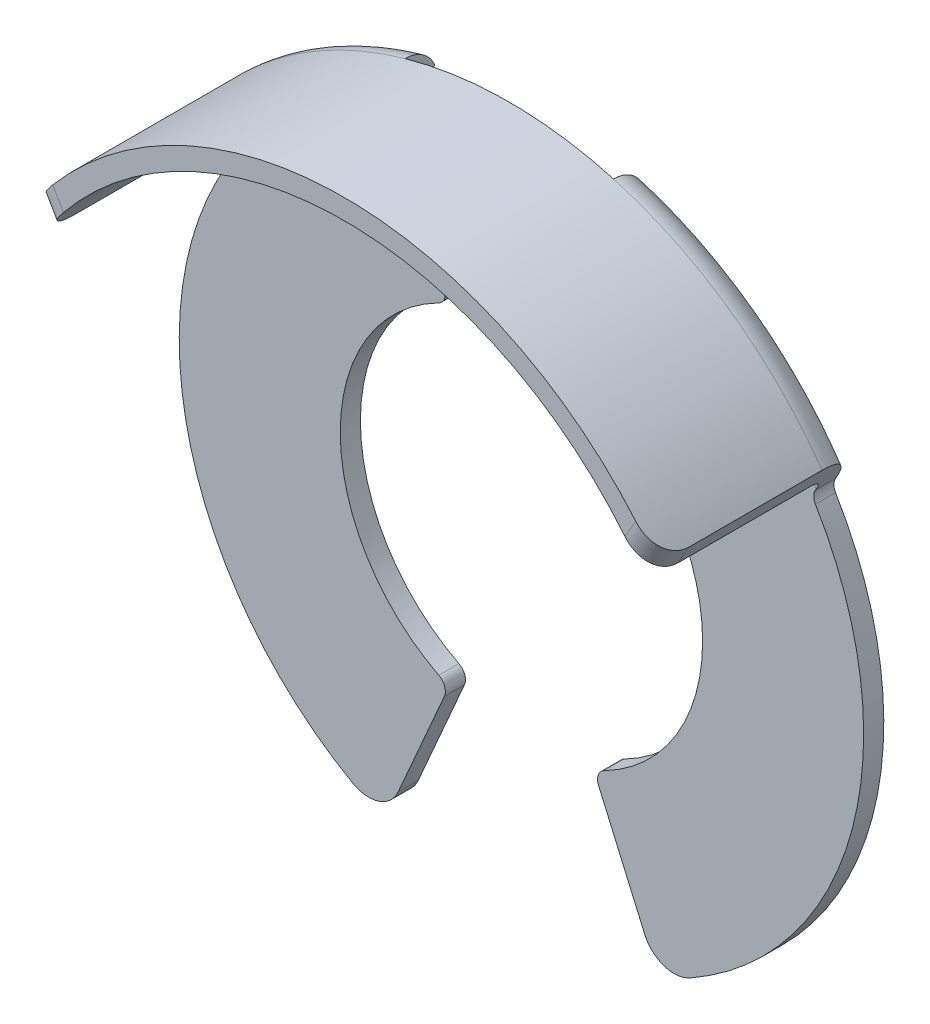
ISO-10303-21;
HEADER;
FILE_DESCRIPTION(('STEP AP214'),'2;1');
FILE_NAME('part.step','',(''),(''),'','','');
FILE_SCHEMA(('AUTOMOTIVE_DESIGN { 1 0 10303 214 1 1 1 1 }'));
ENDSEC;
DATA;
#1=APPLICATION_CONTEXT('core data for automotive mechanical design processes');
#2=APPLICATION_PROTOCOL_DEFINITION('international standard','automotive_design',2000,#1);
#3=PRODUCT_CONTEXT('',#1,'mechanical');
#4=PRODUCT('Part','Part','',(#3));
#5=PRODUCT_RELATED_PRODUCT_CATEGORY('part','',(#4));
#6=PRODUCT_DEFINITION_FORMATION('','',#4);
#7=PRODUCT_DEFINITION_CONTEXT('part definition',#1,'design');
#8=PRODUCT_DEFINITION('design','',#6,#7);
#9=PRODUCT_DEFINITION_SHAPE('','',#8);
#10=(LENGTH_UNIT() NAMED_UNIT(*) SI_UNIT(.MILLI.,.METRE.));
#11=(NAMED_UNIT(*) PLANE_ANGLE_UNIT() SI_UNIT($,.RADIAN.));
#12=(NAMED_UNIT(*) SI_UNIT($,.STERADIAN.) SOLID_ANGLE_UNIT());
#13=UNCERTAINTY_MEASURE_WITH_UNIT(LENGTH_MEASURE(1.E-05),#10,'distance_accuracy_value','');
#14=(GEOMETRIC_REPRESENTATION_CONTEXT(3) GLOBAL_UNCERTAINTY_ASSIGNED_CONTEXT((#13)) GLOBAL_UNIT_ASSIGNED_CONTEXT((#10,
#11,#12)) REPRESENTATION_CONTEXT('',''));
#15=CARTESIAN_POINT('',(0.,0.,0.));
#16=DIRECTION('',(0.,0.,1.));
#17=DIRECTION('',(1.,0.,0.));
#18=AXIS2_PLACEMENT_3D('',#15,#16,#17);
#19=CARTESIAN_POINT('',(0.,0.,-8.8));
#20=DIRECTION('',(0.,0.,1.));
#21=DIRECTION('',(1.,0.,0.));
#22=AXIS2_PLACEMENT_3D('',#19,#20,#21);
#23=CYLINDRICAL_SURFACE('',#22,18.);
#24=DIRECTION('',(0.,0.,1.));
#25=VECTOR('',#24,1.);
#26=CARTESIAN_POINT('',(5.17739130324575,17.2393334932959,-8.8));
#27=LINE('',#26,#25);
#28=CARTESIAN_POINT('',(5.17739130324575,17.239333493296,-9.68323969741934));
#29=VERTEX_POINT('',#28);
#30=CARTESIAN_POINT('',(5.17739130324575,17.2393334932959,-8.2));
#31=VERTEX_POINT('',#30);
#32=EDGE_CURVE('E261',#29,#31,#27,.T.);
#33=ORIENTED_EDGE('',*,*,#32,.F.);
#34=CARTESIAN_POINT('',(0.,0.,-9.68323969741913));
#35=DIRECTION('',(0.,0.,1.));
#36=DIRECTION('',(1.,0.,0.));
#37=AXIS2_PLACEMENT_3D('',#34,#35,#36);
#38=CIRCLE('',#37,18.);
#39=CARTESIAN_POINT('',(5.55153584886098,17.1225129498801,-9.68323969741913));
#40=VERTEX_POINT('',#39);
#41=EDGE_CURVE('E703',#29,#40,#38,.F.);
#42=ORIENTED_EDGE('',*,*,#41,.T.);
#43=DIRECTION('',(0.,0.,1.));
#44=VECTOR('',#43,1.);
#45=CARTESIAN_POINT('',(5.55153584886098,17.1225129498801,-9.8));
#46=LINE('',#45,#44);
#47=CARTESIAN_POINT('',(5.55153584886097,17.1225129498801,-8.2));
#48=VERTEX_POINT('',#47);
#49=EDGE_CURVE('E69',#40,#48,#46,.T.);
#50=ORIENTED_EDGE('',*,*,#49,.T.);
#51=CARTESIAN_POINT('',(0.,0.,-8.2));
#52=DIRECTION('',(0.,0.,1.));
#53=DIRECTION('',(1.,0.,0.));
#54=AXIS2_PLACEMENT_3D('',#51,#52,#53);
#55=CIRCLE('',#54,18.);
#56=CARTESIAN_POINT('',(14.9842770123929,9.97353710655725,-8.2));
#57=VERTEX_POINT('',#56);
#58=EDGE_CURVE('E604',#48,#57,#55,.F.);
#59=ORIENTED_EDGE('',*,*,#58,.T.);
#60=DIRECTION('',(0.,0.,1.));
#61=VECTOR('',#60,1.);
#62=CARTESIAN_POINT('',(14.9842770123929,9.97353710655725,-8.8));
#63=LINE('',#62,#61);
#64=CARTESIAN_POINT('',(14.9842770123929,9.97353710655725,-1.6));
#65=VERTEX_POINT('',#64);
#66=EDGE_CURVE('E411',#57,#65,#63,.T.);
#67=ORIENTED_EDGE('',*,*,#66,.T.);
#68=CARTESIAN_POINT('',(14.9842770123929,9.97353710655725,-1.6));
#69=CARTESIAN_POINT('',(14.984277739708,9.97353435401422,-1.55813709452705));
#70=CARTESIAN_POINT('',(14.9832604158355,9.97506460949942,-1.51629585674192));
#71=CARTESIAN_POINT('',(14.9792080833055,9.9811494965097,-1.43294482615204));
#72=CARTESIAN_POINT('',(14.9761736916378,9.98570320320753,-1.39143493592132));
#73=CARTESIAN_POINT('',(14.9641093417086,10.0037819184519,-1.26818144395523));
#74=CARTESIAN_POINT('',(14.9521177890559,10.0217253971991,-1.1873171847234));
#75=CARTESIAN_POINT('',(14.9206887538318,10.068457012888,-1.0304555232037));
#76=CARTESIAN_POINT('',(14.9012567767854,10.0972371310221,-0.954454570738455));
#77=CARTESIAN_POINT('',(14.8555766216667,10.1643241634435,-0.808943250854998));
#78=CARTESIAN_POINT('',(14.8293234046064,10.2026381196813,-0.739437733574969));
#79=CARTESIAN_POINT('',(14.7693554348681,10.2892679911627,-0.60524678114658));
#80=CARTESIAN_POINT('',(14.7353471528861,10.337970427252,-0.540943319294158));
#81=CARTESIAN_POINT('',(14.6615277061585,10.4423988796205,-0.422128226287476));
#82=CARTESIAN_POINT('',(14.621714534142,10.4981273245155,-0.367619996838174));
#83=CARTESIAN_POINT('',(14.533053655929,10.6205738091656,-0.264472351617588));
#84=CARTESIAN_POINT('',(14.4837049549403,10.6878333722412,-0.216905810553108));
#85=CARTESIAN_POINT('',(14.3801751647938,10.8267297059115,-0.135353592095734));
#86=CARTESIAN_POINT('',(14.3259929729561,10.8983674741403,-0.10137102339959));
#87=CARTESIAN_POINT('',(14.2186554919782,11.0379747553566,-0.049886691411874));
#88=CARTESIAN_POINT('',(14.165792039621,11.1057512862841,-0.0312459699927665));
#89=CARTESIAN_POINT('',(14.058031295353,11.2418614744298,-0.006298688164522));
#90=CARTESIAN_POINT('',(14.0031356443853,11.3101946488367,1.76116758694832E-05));
#91=CARTESIAN_POINT('',(13.9476963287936,11.3781266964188,0.));
#92=B_SPLINE_CURVE_WITH_KNOTS('',3,(#68,#69,#70,#71,#72,#73,#74,#75,#76,#77,#78,#79,#80,#81,#82,
#83,#84,#85,#86,#87,#88,#89,#90,#91),.UNSPECIFIED.,.F.,.F.,(4,2,2,2,2,2,2,2,2,2,2,4),(0.,
0.125506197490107,0.250974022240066,0.500735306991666,0.750312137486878,1.00007386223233,
1.26161596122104,1.5232487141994,1.81011210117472,2.09704109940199,2.36001827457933,
2.62278754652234),.UNSPECIFIED.);
#93=CARTESIAN_POINT('',(13.9476963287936,11.3781266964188,0.));
#94=VERTEX_POINT('',#93);
#95=EDGE_CURVE('E465',#65,#94,#92,.T.);
#96=ORIENTED_EDGE('',*,*,#95,.T.);
#97=CARTESIAN_POINT('',(0.,0.,0.));
#98=DIRECTION('',(0.,0.,1.));
#99=DIRECTION('',(1.,0.,0.));
#100=AXIS2_PLACEMENT_3D('',#97,#98,#99);
#101=CIRCLE('',#100,18.);
#102=CARTESIAN_POINT('',(-13.9476963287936,11.3781266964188,0.));
#103=VERTEX_POINT('',#102);
#104=EDGE_CURVE('E397',#94,#103,#101,.T.);
#105=ORIENTED_EDGE('',*,*,#104,.T.);
#106=CARTESIAN_POINT('',(-13.9476963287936,11.3781266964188,0.));
#107=CARTESIAN_POINT('',(-14.0131210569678,11.2979801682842,3.70209437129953E-05));
#108=CARTESIAN_POINT('',(-14.0777775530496,11.2172590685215,-0.00876839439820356));
#109=CARTESIAN_POINT('',(-14.2039839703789,11.0569853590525,-0.0434270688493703));
#110=CARTESIAN_POINT('',(-14.2655323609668,10.977433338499,-0.0692886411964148));
#111=CARTESIAN_POINT('',(-14.3839041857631,10.8218736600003,-0.137432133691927));
#112=CARTESIAN_POINT('',(-14.440726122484,10.7458671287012,-0.179719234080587));
#113=CARTESIAN_POINT('',(-14.548179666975,10.5999367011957,-0.279820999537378));
#114=CARTESIAN_POINT('',(-14.5988127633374,10.5300113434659,-0.337631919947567));
#115=CARTESIAN_POINT('',(-14.6916821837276,10.4000366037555,-0.466516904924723));
#116=CARTESIAN_POINT('',(-14.7340467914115,10.3398393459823,-0.537348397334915));
#117=CARTESIAN_POINT('',(-14.8100619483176,10.2306647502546,-0.691345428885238));
#118=CARTESIAN_POINT('',(-14.843714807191,10.1816844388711,-0.774507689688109));
#119=CARTESIAN_POINT('',(-14.8986276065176,10.1011428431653,-0.94362591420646));
#120=CARTESIAN_POINT('',(-14.9206715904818,10.068490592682,-1.02880758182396));
#121=CARTESIAN_POINT('',(-14.9553142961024,10.0169635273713,-1.20497646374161));
#122=CARTESIAN_POINT('',(-14.9679341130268,9.99805794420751,-1.29595021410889));
#123=CARTESIAN_POINT('',(-14.978463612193,9.98226655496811,-1.42321392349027));
#124=CARTESIAN_POINT('',(-14.9806431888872,9.9789947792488,-1.45847929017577));
#125=CARTESIAN_POINT('',(-14.9835483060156,9.9746321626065,-1.5291564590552));
#126=CARTESIAN_POINT('',(-14.9842758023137,9.97353838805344,-1.56456799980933));
#127=CARTESIAN_POINT('',(-14.9842770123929,9.97353710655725,-1.6));
#128=B_SPLINE_CURVE_WITH_KNOTS('',3,(#106,#107,#108,#109,#110,#111,#112,#113,#114,#115,#116,
#117,#118,#119,#120,#121,#122,#123,#124,#125,#126,#127),.UNSPECIFIED.,.F.,.F.,(4,2,2,2,2,2,2,2,
2,2,4),(0.,0.309949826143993,0.620050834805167,0.930249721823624,1.24037384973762,
1.54521789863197,1.84998104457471,2.13001384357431,2.40941791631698,2.51579246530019,
2.62202363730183),.UNSPECIFIED.);
#129=CARTESIAN_POINT('',(-14.9842770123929,9.97353710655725,-1.6));
#130=VERTEX_POINT('',#129);
#131=EDGE_CURVE('E456',#103,#130,#128,.T.);
#132=ORIENTED_EDGE('',*,*,#131,.T.);
#133=DIRECTION('',(0.,0.,1.));
#134=VECTOR('',#133,1.);
#135=CARTESIAN_POINT('',(-14.9842770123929,9.97353710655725,-8.8));
#136=LINE('',#135,#134);
#137=CARTESIAN_POINT('',(-14.9842770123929,9.97353710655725,-8.2));
#138=VERTEX_POINT('',#137);
#139=EDGE_CURVE('E418',#130,#138,#136,.F.);
#140=ORIENTED_EDGE('',*,*,#139,.T.);
#141=CARTESIAN_POINT('',(0.,0.,-8.2));
#142=DIRECTION('',(0.,0.,1.));
#143=DIRECTION('',(1.,0.,0.));
#144=AXIS2_PLACEMENT_3D('',#141,#142,#143);
#145=CIRCLE('',#144,18.);
#146=CARTESIAN_POINT('',(-5.55153584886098,17.1225129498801,-8.2));
#147=VERTEX_POINT('',#146);
#148=EDGE_CURVE('E600',#138,#147,#145,.F.);
#149=ORIENTED_EDGE('',*,*,#148,.T.);
#150=DIRECTION('',(0.,0.,1.));
#151=VECTOR('',#150,1.);
#152=CARTESIAN_POINT('',(-5.55153584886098,17.1225129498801,-9.8));
#153=LINE('',#152,#151);
#154=CARTESIAN_POINT('',(-5.55153584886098,17.1225129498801,-9.68323969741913));
#155=VERTEX_POINT('',#154);
#156=EDGE_CURVE('E349',#155,#147,#153,.T.);
#157=ORIENTED_EDGE('',*,*,#156,.F.);
#158=CARTESIAN_POINT('',(-5.17739130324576,17.239333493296,-9.68323969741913));
#159=VERTEX_POINT('',#158);
#160=EDGE_CURVE('E696',#155,#159,#38,.F.);
#161=ORIENTED_EDGE('',*,*,#160,.T.);
#162=DIRECTION('',(0.,0.,1.));
#163=VECTOR('',#162,1.);
#164=CARTESIAN_POINT('',(-5.17739130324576,17.2393334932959,-8.8));
#165=LINE('',#164,#163);
#166=CARTESIAN_POINT('',(-5.17739130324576,17.2393334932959,-8.2));
#167=VERTEX_POINT('',#166);
#168=EDGE_CURVE('E269',#167,#159,#165,.F.);
#169=ORIENTED_EDGE('',*,*,#168,.F.);
#170=CARTESIAN_POINT('',(0.,0.,-8.2));
#171=DIRECTION('',(0.,0.,-1.));
#172=DIRECTION('',(-1.,0.,0.));
#173=AXIS2_PLACEMENT_3D('',#170,#171,#172);
#174=CIRCLE('',#173,18.);
#175=EDGE_CURVE('E273',#31,#167,#174,.F.);
#176=ORIENTED_EDGE('',*,*,#175,.F.);
#177=EDGE_LOOP('',(#33,#42,#50,#59,#67,#96,#105,#132,#140,#149,#157,#161,#169,#176));
#178=FACE_BOUND('',#177,.T.);
#179=ADVANCED_FACE('F39',(#178),#23,.F.);
#180=CARTESIAN_POINT('',(0.,0.,-8.2));
#181=DIRECTION('',(0.,0.,1.));
#182=DIRECTION('',(1.,0.,0.));
#183=AXIS2_PLACEMENT_3D('',#180,#181,#182);
#184=TOROIDAL_SURFACE('',#183,17.4,1.6);
#185=ORIENTED_EDGE('',*,*,#41,.F.);
#186=CARTESIAN_POINT('',(5.17739130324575,15.2723389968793,-9.16802355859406));
#187=CARTESIAN_POINT('',(5.17739130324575,15.3313602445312,-9.24157736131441));
#188=CARTESIAN_POINT('',(5.17739130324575,15.3968889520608,-9.31002651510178));
#189=CARTESIAN_POINT('',(5.17739130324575,15.5386692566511,-9.43489976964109));
#190=CARTESIAN_POINT('',(5.17739130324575,15.6149408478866,-9.4913009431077));
#191=CARTESIAN_POINT('',(5.17739130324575,15.7755668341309,-9.59057627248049));
#192=CARTESIAN_POINT('',(5.17739130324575,15.8599010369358,-9.63348312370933));
#193=CARTESIAN_POINT('',(5.17739130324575,16.0343682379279,-9.70502948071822));
#194=CARTESIAN_POINT('',(5.17739130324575,16.1244994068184,-9.7336734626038));
#195=CARTESIAN_POINT('',(5.17739130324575,16.3111983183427,-9.77681852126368));
#196=CARTESIAN_POINT('',(5.17739130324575,16.4078801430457,-9.79082701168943));
#197=CARTESIAN_POINT('',(5.17739130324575,16.6022451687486,-9.80267003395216));
#198=CARTESIAN_POINT('',(5.17739130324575,16.6999285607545,-9.80050142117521));
#199=CARTESIAN_POINT('',(5.17739130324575,16.8949501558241,-9.77980457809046));
#200=CARTESIAN_POINT('',(5.17739130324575,16.9922642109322,-9.76104684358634));
#201=CARTESIAN_POINT('',(5.17739130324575,17.1822689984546,-9.70718319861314));
#202=CARTESIAN_POINT('',(5.17739130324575,17.2749599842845,-9.67207818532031));
#203=CARTESIAN_POINT('',(5.17739130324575,17.4513401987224,-9.58700354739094));
#204=CARTESIAN_POINT('',(5.17739130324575,17.5351546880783,-9.53729408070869));
#205=CARTESIAN_POINT('',(5.17739130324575,17.6928217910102,-9.42399742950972));
#206=CARTESIAN_POINT('',(5.17739130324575,17.7666764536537,-9.36041310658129));
#207=CARTESIAN_POINT('',(5.17739130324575,17.8993511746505,-9.22367527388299));
#208=CARTESIAN_POINT('',(5.17739130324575,17.9586277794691,-9.15096492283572));
#209=CARTESIAN_POINT('',(5.17739130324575,18.0635212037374,-8.99627737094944));
#210=CARTESIAN_POINT('',(5.17739130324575,18.1091414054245,-8.91430247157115));
#211=CARTESIAN_POINT('',(5.17739130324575,18.1835290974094,-8.74697276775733));
#212=CARTESIAN_POINT('',(5.17739130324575,18.2128998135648,-8.6618859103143));
#213=CARTESIAN_POINT('',(5.17739130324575,18.2564845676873,-8.48791690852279));
#214=CARTESIAN_POINT('',(5.17739130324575,18.2707014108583,-8.39903546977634));
#215=CARTESIAN_POINT('',(5.17739130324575,18.2832925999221,-8.22261898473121));
#216=CARTESIAN_POINT('',(5.17739130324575,18.2820910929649,-8.13511394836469));
#217=CARTESIAN_POINT('',(5.17739130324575,18.2649159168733,-7.96157125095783));
#218=CARTESIAN_POINT('',(5.17739130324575,18.2489432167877,-7.87553349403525));
#219=CARTESIAN_POINT('',(5.17739130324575,18.2029117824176,-7.70786621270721));
#220=CARTESIAN_POINT('',(5.17739130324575,18.1729362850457,-7.6262137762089));
#221=CARTESIAN_POINT('',(5.17739130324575,18.0999201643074,-7.46898421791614));
#222=CARTESIAN_POINT('',(5.17739130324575,18.056878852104,-7.39340741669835));
#223=CARTESIAN_POINT('',(5.17739130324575,17.9582700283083,-7.24907037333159));
#224=CARTESIAN_POINT('',(5.17739130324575,17.90250563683,-7.18044478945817));
#225=CARTESIAN_POINT('',(5.17739130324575,17.780588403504,-7.05315337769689));
#226=CARTESIAN_POINT('',(5.17739130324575,17.7144340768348,-6.99448897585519));
#227=CARTESIAN_POINT('',(5.17739130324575,17.5712726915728,-6.88665321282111));
#228=CARTESIAN_POINT('',(5.17739130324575,17.4939757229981,-6.83786692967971));
#229=CARTESIAN_POINT('',(5.17739130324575,17.3325351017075,-6.75338844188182));
#230=CARTESIAN_POINT('',(5.17739130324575,17.2483901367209,-6.71769875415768));
#231=CARTESIAN_POINT('',(5.17739130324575,17.0720607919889,-6.65894845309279));
#232=CARTESIAN_POINT('',(5.17739130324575,16.9796896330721,-6.63644816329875));
#233=CARTESIAN_POINT('',(5.17739130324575,16.7925184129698,-6.60674252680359));
#234=CARTESIAN_POINT('',(5.17739130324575,16.6977178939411,-6.59954008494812));
#235=CARTESIAN_POINT('',(5.17739130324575,16.5051583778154,-6.60052075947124));
#236=CARTESIAN_POINT('',(5.17739130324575,16.4074016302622,-6.60920279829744));
#237=CARTESIAN_POINT('',(5.17739130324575,16.2146797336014,-6.64269169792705));
#238=CARTESIAN_POINT('',(5.17739130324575,16.119714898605,-6.66750036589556));
#239=CARTESIAN_POINT('',(5.17739130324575,15.9344392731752,-6.73297583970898));
#240=CARTESIAN_POINT('',(5.17739130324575,15.8441780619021,-6.7737833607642));
#241=CARTESIAN_POINT('',(5.17739130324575,15.6720012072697,-6.87031626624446));
#242=CARTESIAN_POINT('',(5.17739130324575,15.5900849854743,-6.92604061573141));
#243=CARTESIAN_POINT('',(5.17739130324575,15.4391060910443,-7.04959688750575));
#244=CARTESIAN_POINT('',(5.17739130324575,15.3697888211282,-7.11711713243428));
#245=CARTESIAN_POINT('',(5.17739130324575,15.2441895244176,-7.26336499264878));
#246=CARTESIAN_POINT('',(5.17739130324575,15.1879035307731,-7.34208918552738));
#247=CARTESIAN_POINT('',(5.17739130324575,15.0929859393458,-7.50437551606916));
#248=CARTESIAN_POINT('',(5.17739130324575,15.0536221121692,-7.58750918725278));
#249=CARTESIAN_POINT('',(5.17739130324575,14.9902565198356,-7.75943279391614));
#250=CARTESIAN_POINT('',(5.17739130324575,14.9662486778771,-7.8482204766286));
#251=CARTESIAN_POINT('',(5.17739130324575,14.935397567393,-8.02413250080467));
#252=CARTESIAN_POINT('',(5.17739130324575,14.9277544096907,-8.11111721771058));
#253=CARTESIAN_POINT('',(5.17739130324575,14.927540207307,-8.28512443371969));
#254=CARTESIAN_POINT('',(5.17739130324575,14.9349708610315,-8.37214693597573));
#255=CARTESIAN_POINT('',(5.17739130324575,14.9642850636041,-8.54178979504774));
#256=CARTESIAN_POINT('',(5.17739130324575,14.9858579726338,-8.62446440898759));
#257=CARTESIAN_POINT('',(5.17739130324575,15.0423354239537,-8.78503703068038));
#258=CARTESIAN_POINT('',(5.17739130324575,15.0772234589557,-8.86294081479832));
#259=CARTESIAN_POINT('',(5.17739130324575,15.1404079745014,-8.97804856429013));
#260=CARTESIAN_POINT('',(5.17739130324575,15.1644747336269,-9.01763549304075));
#261=CARTESIAN_POINT('',(5.17739130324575,15.215951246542,-9.09456621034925));
#262=CARTESIAN_POINT('',(5.17739130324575,15.2433607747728,-9.13191015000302));
#263=CARTESIAN_POINT('',(5.17739130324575,15.2723389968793,-9.16802355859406));
#264=B_SPLINE_CURVE_WITH_KNOTS('',3,(#186,#187,#188,#189,#190,#191,#192,#193,#194,#195,#196,
#197,#198,#199,#200,#201,#202,#203,#204,#205,#206,#207,#208,#209,#210,#211,#212,#213,#214,#215,
#216,#217,#218,#219,#220,#221,#222,#223,#224,#225,#226,#227,#228,#229,#230,#231,#232,#233,#234,
#235,#236,#237,#238,#239,#240,#241,#242,#243,#244,#245,#246,#247,#248,#249,#250,#251,#252,#253,
#254,#255,#256,#257,#258,#259,#260,#261,#262,#263),.UNSPECIFIED.,.T.,.F.,(4,2,2,2,2,2,2,2,2,2,2,
2,2,2,2,2,2,2,2,2,2,2,2,2,2,2,2,2,2,2,2,2,2,2,2,2,2,2,4),(0.,0.282740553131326,
0.566014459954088,0.848596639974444,1.13109008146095,1.42281196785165,1.71459056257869,
2.01047007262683,2.3063333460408,2.59721644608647,2.88803961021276,3.16806053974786,
3.44801205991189,3.71672076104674,3.98537971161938,4.24666427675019,4.50793170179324,
4.76766545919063,5.02741291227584,5.29149103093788,5.5556069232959,5.82859479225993,
6.10163509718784,6.38556274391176,6.66954429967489,6.96259909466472,7.25568673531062,
7.5514121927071,7.84711713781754,8.13594586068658,8.42468654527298,8.69922401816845,
8.97365278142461,9.23432887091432,9.49503433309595,9.75019697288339,10.0050442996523,
10.1438734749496,10.2826932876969),.UNSPECIFIED.);
#265=CARTESIAN_POINT('',(5.17739130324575,18.2809906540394,-8.2));
#266=VERTEX_POINT('',#265);
#267=EDGE_CURVE('E11',#29,#266,#264,.T.);
#268=ORIENTED_EDGE('',*,*,#267,.T.);
#269=CARTESIAN_POINT('',(0.,0.,-8.2));
#270=DIRECTION('',(0.,0.,1.));
#271=DIRECTION('',(1.,0.,0.));
#272=AXIS2_PLACEMENT_3D('',#269,#270,#271);
#273=CIRCLE('',#272,19.);
#274=CARTESIAN_POINT('',(15.5387036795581,10.9338322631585,-8.2));
#275=VERTEX_POINT('',#274);
#276=EDGE_CURVE('E699',#275,#266,#273,.T.);
#277=ORIENTED_EDGE('',*,*,#276,.F.);
#278=CARTESIAN_POINT('',(14.6480575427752,9.39118790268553,-9.8));
#279=CARTESIAN_POINT('',(14.7029188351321,9.48621044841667,-9.80004074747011));
#280=CARTESIAN_POINT('',(14.757824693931,9.58131018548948,-9.79109190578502));
#281=CARTESIAN_POINT('',(14.8663430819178,9.76926954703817,-9.75514373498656));
#282=CARTESIAN_POINT('',(14.9199499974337,9.86211944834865,-9.72807693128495));
#283=CARTESIAN_POINT('',(15.024171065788,10.0426356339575,-9.65573915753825));
#284=CARTESIAN_POINT('',(15.0747781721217,10.1302897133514,-9.61042713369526));
#285=CARTESIAN_POINT('',(15.1709713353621,10.2969011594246,-9.50215880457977));
#286=CARTESIAN_POINT('',(15.2165653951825,10.3758723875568,-9.43923120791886));
#287=CARTESIAN_POINT('',(15.2976568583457,10.5163269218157,-9.30232053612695));
#288=CARTESIAN_POINT('',(15.3336566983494,10.5786804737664,-9.22953108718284));
#289=CARTESIAN_POINT('',(15.3981619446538,10.6904068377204,-9.07160697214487));
#290=CARTESIAN_POINT('',(15.4266687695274,10.739782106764,-8.98647464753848));
#291=CARTESIAN_POINT('',(15.4721493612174,10.8185568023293,-8.81615182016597));
#292=CARTESIAN_POINT('',(15.4900241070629,10.8495167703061,-8.73192000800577));
#293=CARTESIAN_POINT('',(15.5177267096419,10.8974990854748,-8.55840594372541));
#294=CARTESIAN_POINT('',(15.527572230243,10.9145520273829,-8.46913524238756));
#295=CARTESIAN_POINT('',(15.5350149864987,10.9274432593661,-8.34924818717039));
#296=CARTESIAN_POINT('',(15.5363983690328,10.9298393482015,-8.31944234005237));
#297=CARTESIAN_POINT('',(15.5382414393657,10.93303163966,-8.25976265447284));
#298=CARTESIAN_POINT('',(15.5387025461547,10.9338303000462,-8.2298889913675));
#299=CARTESIAN_POINT('',(15.5387036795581,10.9338322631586,-8.2));
#300=B_SPLINE_CURVE_WITH_KNOTS('',3,(#278,#279,#280,#281,#282,#283,#284,#285,#286,#287,#288,
#289,#290,#291,#292,#293,#294,#295,#296,#297,#298,#299),.UNSPECIFIED.,.F.,.F.,(4,2,2,2,2,2,2,2,
2,2,4),(0.,0.32894738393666,0.659126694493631,0.990053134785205,1.3204433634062,
1.62588536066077,1.93126949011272,2.20435082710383,2.47682976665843,2.56659018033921,
2.65621238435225),.UNSPECIFIED.);
#301=CARTESIAN_POINT('',(14.6480575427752,9.39118790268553,-9.8));
#302=VERTEX_POINT('',#301);
#303=EDGE_CURVE('E527',#302,#275,#300,.T.);
#304=ORIENTED_EDGE('',*,*,#303,.F.);
#305=CARTESIAN_POINT('',(0.,0.,-9.8));
#306=DIRECTION('',(0.,0.,1.));
#307=DIRECTION('',(1.,0.,0.));
#308=AXIS2_PLACEMENT_3D('',#305,#306,#307);
#309=CIRCLE('',#308,17.4);
#310=CARTESIAN_POINT('',(6.57477812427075,16.1100059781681,-9.8));
#311=VERTEX_POINT('',#310);
#312=EDGE_CURVE('E693',#311,#302,#309,.F.);
#313=ORIENTED_EDGE('',*,*,#312,.F.);
#314=CARTESIAN_POINT('',(5.55153584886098,17.1225129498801,-9.68323969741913));
#315=CARTESIAN_POINT('',(5.59349379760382,17.1089154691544,-9.68322455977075));
#316=CARTESIAN_POINT('',(5.6348801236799,17.093573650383,-9.68391153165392));
#317=CARTESIAN_POINT('',(5.7161950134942,17.0595535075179,-9.68657732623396));
#318=CARTESIAN_POINT('',(5.75612418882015,17.040876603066,-9.68855560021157));
#319=CARTESIAN_POINT('',(5.8341514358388,17.0003759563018,-9.69368556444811));
#320=CARTESIAN_POINT('',(5.87225372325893,16.9785599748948,-9.69683439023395));
#321=CARTESIAN_POINT('',(5.94646735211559,16.9319267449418,-9.70409465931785));
#322=CARTESIAN_POINT('',(5.98257854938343,16.9071092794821,-9.70820617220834));
#323=CARTESIAN_POINT('',(6.08751346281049,16.8284619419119,-9.72159888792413));
#324=CARTESIAN_POINT('',(6.15307397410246,16.7703664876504,-9.73194872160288));
#325=CARTESIAN_POINT('',(6.27379788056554,16.6443601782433,-9.7529079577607));
#326=CARTESIAN_POINT('',(6.32896514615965,16.5764529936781,-9.76351726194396));
#327=CARTESIAN_POINT('',(6.41976301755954,16.4438114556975,-9.78052487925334));
#328=CARTESIAN_POINT('',(6.45710671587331,16.3803030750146,-9.78732514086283));
#329=CARTESIAN_POINT('',(6.5228575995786,16.2484685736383,-9.79705848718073));
#330=CARTESIAN_POINT('',(6.55125420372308,16.1801368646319,-9.79998700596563));
#331=CARTESIAN_POINT('',(6.57477812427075,16.1100059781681,-9.8));
#332=B_SPLINE_CURVE_WITH_KNOTS('',3,(#314,#315,#316,#317,#318,#319,#320,#321,#322,#323,#324,
#325,#326,#327,#328,#329,#330,#331),.UNSPECIFIED.,.F.,.F.,(4,2,2,2,2,2,2,2,4),(0.,
0.13226588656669,0.264475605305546,0.396363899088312,0.528261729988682,0.791603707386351,
1.05484742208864,1.27604027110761,1.4974937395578),.UNSPECIFIED.);
#333=EDGE_CURVE('E694',#40,#311,#332,.T.);
#334=ORIENTED_EDGE('',*,*,#333,.F.);
#335=EDGE_LOOP('',(#185,#268,#277,#304,#313,#334));
#336=FACE_BOUND('',#335,.T.);
#337=ADVANCED_FACE('F482',(#336),#184,.T.);
#338=CARTESIAN_POINT('',(-5.17739130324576,18.2809906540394,-8.2));
#339=VERTEX_POINT('',#338);
#340=CARTESIAN_POINT('',(-15.5387036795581,10.9338322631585,-8.2));
#341=VERTEX_POINT('',#340);
#342=EDGE_CURVE('E702',#339,#341,#273,.T.);
#343=ORIENTED_EDGE('',*,*,#342,.F.);
#344=CARTESIAN_POINT('',(-5.17739130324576,15.2723389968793,-9.16802355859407));
#345=CARTESIAN_POINT('',(-5.17739130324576,15.2175338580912,-9.0997125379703));
#346=CARTESIAN_POINT('',(-5.17739130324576,15.1682615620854,-9.02690650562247));
#347=CARTESIAN_POINT('',(-5.17739130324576,15.0824630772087,-8.8740748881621));
#348=CARTESIAN_POINT('',(-5.17739130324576,15.0459445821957,-8.79404498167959));
#349=CARTESIAN_POINT('',(-5.17739130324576,14.9869824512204,-8.62881918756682));
#350=CARTESIAN_POINT('',(-5.17739130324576,14.9645572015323,-8.54361670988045));
#351=CARTESIAN_POINT('',(-5.17739130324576,14.9347527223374,-8.37063047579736));
#352=CARTESIAN_POINT('',(-5.17739130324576,14.9273698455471,-8.28284735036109));
#353=CARTESIAN_POINT('',(-5.17739130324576,14.9279313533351,-8.10950289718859));
#354=CARTESIAN_POINT('',(-5.17739130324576,14.9355024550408,-8.02394013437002));
#355=CARTESIAN_POINT('',(-5.17739130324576,14.9649340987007,-7.8553162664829));
#356=CARTESIAN_POINT('',(-5.17739130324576,14.9867944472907,-7.7722551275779));
#357=CARTESIAN_POINT('',(-5.17739130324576,15.0439449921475,-7.61103188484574));
#358=CARTESIAN_POINT('',(-5.17739130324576,15.0792170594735,-7.5328633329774));
#359=CARTESIAN_POINT('',(-5.17739130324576,15.1619610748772,-7.38328595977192));
#360=CARTESIAN_POINT('',(-5.17739130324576,15.2094346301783,-7.31187803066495));
#361=CARTESIAN_POINT('',(-5.17739130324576,15.3168937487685,-7.17515771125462));
#362=CARTESIAN_POINT('',(-5.17739130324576,15.3772542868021,-7.11014039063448));
#363=CARTESIAN_POINT('',(-5.17739130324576,15.5075560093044,-6.99055389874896));
#364=CARTESIAN_POINT('',(-5.17739130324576,15.5774994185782,-6.93598716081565));
#365=CARTESIAN_POINT('',(-5.17739130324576,15.7288137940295,-6.83590206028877));
#366=CARTESIAN_POINT('',(-5.17739130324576,15.810586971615,-6.7909916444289));
#367=CARTESIAN_POINT('',(-5.17739130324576,15.9802797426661,-6.71487293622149));
#368=CARTESIAN_POINT('',(-5.17739130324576,16.0682007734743,-6.68366786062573));
#369=CARTESIAN_POINT('',(-5.17739130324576,16.2518004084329,-6.63455002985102));
#370=CARTESIAN_POINT('',(-5.17739130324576,16.3476501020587,-6.61727508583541));
#371=CARTESIAN_POINT('',(-5.17739130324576,16.5408929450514,-6.59875435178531));
#372=CARTESIAN_POINT('',(-5.17739130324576,16.6382863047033,-6.59751076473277));
#373=CARTESIAN_POINT('',(-5.17739130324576,16.8336202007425,-6.61127592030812));
#374=CARTESIAN_POINT('',(-5.17739130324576,16.931541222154,-6.62656523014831));
#375=CARTESIAN_POINT('',(-5.17739130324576,17.1233611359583,-6.6735952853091));
#376=CARTESIAN_POINT('',(-5.17739130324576,17.2172601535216,-6.7053355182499));
#377=CARTESIAN_POINT('',(-5.17739130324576,17.3968968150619,-6.7840506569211));
#378=CARTESIAN_POINT('',(-5.17739130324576,17.4827298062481,-6.83080753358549));
#379=CARTESIAN_POINT('',(-5.17739130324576,17.644935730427,-6.9385764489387));
#380=CARTESIAN_POINT('',(-5.17739130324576,17.7213104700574,-6.99958575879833));
#381=CARTESIAN_POINT('',(-5.17739130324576,17.8594579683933,-7.13182680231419));
#382=CARTESIAN_POINT('',(-5.17739130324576,17.921655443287,-7.20261462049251));
#383=CARTESIAN_POINT('',(-5.17739130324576,18.0326753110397,-7.35400358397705));
#384=CARTESIAN_POINT('',(-5.17739130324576,18.0815010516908,-7.43460226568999));
#385=CARTESIAN_POINT('',(-5.17739130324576,18.1623183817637,-7.59978210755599));
#386=CARTESIAN_POINT('',(-5.17739130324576,18.1949138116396,-7.68406802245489));
#387=CARTESIAN_POINT('',(-5.17739130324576,18.2450066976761,-7.85701154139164));
#388=CARTESIAN_POINT('',(-5.17739130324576,18.2625070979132,-7.9456682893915));
#389=CARTESIAN_POINT('',(-5.17739130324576,18.2814950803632,-8.12204031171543));
#390=CARTESIAN_POINT('',(-5.17739130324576,18.2834373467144,-8.20970690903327));
#391=CARTESIAN_POINT('',(-5.17739130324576,18.2724387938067,-8.38409636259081));
#392=CARTESIAN_POINT('',(-5.17739130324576,18.2594991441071,-8.47081929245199));
#393=CARTESIAN_POINT('',(-5.17739130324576,18.2193546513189,-8.64012684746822));
#394=CARTESIAN_POINT('',(-5.17739130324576,18.1922691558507,-8.72273985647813));
#395=CARTESIAN_POINT('',(-5.17739130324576,18.1248051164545,-8.88233896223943));
#396=CARTESIAN_POINT('',(-5.17739130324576,18.0844260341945,-8.95932483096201));
#397=CARTESIAN_POINT('',(-5.17739130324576,17.9909862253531,-9.10673349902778));
#398=CARTESIAN_POINT('',(-5.17739130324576,17.9377503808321,-9.1770451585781));
#399=CARTESIAN_POINT('',(-5.17739130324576,17.8205690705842,-9.30808166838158));
#400=CARTESIAN_POINT('',(-5.17739130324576,17.7566221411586,-9.36880520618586));
#401=CARTESIAN_POINT('',(-5.17739130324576,17.6176679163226,-9.48106519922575));
#402=CARTESIAN_POINT('',(-5.17739130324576,17.5423704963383,-9.53224233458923));
#403=CARTESIAN_POINT('',(-5.17739130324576,17.3845171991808,-9.62179211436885));
#404=CARTESIAN_POINT('',(-5.17739130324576,17.3019599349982,-9.66016230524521));
#405=CARTESIAN_POINT('',(-5.17739130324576,17.1284203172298,-9.72460869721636));
#406=CARTESIAN_POINT('',(-5.17739130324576,17.0372333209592,-9.75013400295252));
#407=CARTESIAN_POINT('',(-5.17739130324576,16.8519303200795,-9.78606436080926));
#408=CARTESIAN_POINT('',(-5.17739130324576,16.7578138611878,-9.79646705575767));
#409=CARTESIAN_POINT('',(-5.17739130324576,16.5659730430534,-9.80210882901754));
#410=CARTESIAN_POINT('',(-5.17739130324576,16.4682331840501,-9.79682976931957));
#411=CARTESIAN_POINT('',(-5.17739130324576,16.2749441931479,-9.77014964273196));
#412=CARTESIAN_POINT('',(-5.17739130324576,16.1793958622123,-9.74874277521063));
#413=CARTESIAN_POINT('',(-5.17739130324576,15.9920363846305,-9.68993425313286));
#414=CARTESIAN_POINT('',(-5.17739130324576,15.9002867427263,-9.65233636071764));
#415=CARTESIAN_POINT('',(-5.17739130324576,15.7246514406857,-9.56199278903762));
#416=CARTESIAN_POINT('',(-5.17739130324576,15.6407565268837,-9.50926523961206));
#417=CARTESIAN_POINT('',(-5.17739130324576,15.5083547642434,-9.40882003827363));
#418=CARTESIAN_POINT('',(-5.17739130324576,15.4570310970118,-9.364765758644));
#419=CARTESIAN_POINT('',(-5.17739130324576,15.3601548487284,-9.27070621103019));
#420=CARTESIAN_POINT('',(-5.17739130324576,15.3146018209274,-9.22070140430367));
#421=CARTESIAN_POINT('',(-5.17739130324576,15.2723389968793,-9.16802355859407));
#422=B_SPLINE_CURVE_WITH_KNOTS('',3,(#344,#345,#346,#347,#348,#349,#350,#351,#352,#353,#354,
#355,#356,#357,#358,#359,#360,#361,#362,#363,#364,#365,#366,#367,#368,#369,#370,#371,#372,#373,
#374,#375,#376,#377,#378,#379,#380,#381,#382,#383,#384,#385,#386,#387,#388,#389,#390,#391,#392,
#393,#394,#395,#396,#397,#398,#399,#400,#401,#402,#403,#404,#405,#406,#407,#408,#409,#410,#411,
#412,#413,#414,#415,#416,#417,#418,#419,#420,#421),.UNSPECIFIED.,.T.,.F.,(4,2,2,2,2,2,2,2,2,2,2,
2,2,2,2,2,2,2,2,2,2,2,2,2,2,2,2,2,2,2,2,2,2,2,2,2,2,2,4),(0.,0.262505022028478,
0.525168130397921,0.788173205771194,1.05111450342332,1.30757514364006,1.56403231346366,
1.82014404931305,2.07628953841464,2.34126694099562,2.60630596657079,2.88494443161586,
3.16364826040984,3.45448523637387,3.74536217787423,4.04125397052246,4.33713654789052,
4.62890388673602,4.92061540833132,5.2018884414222,5.48309098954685,5.75285799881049,
6.02257238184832,6.28437455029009,6.54615614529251,6.80576395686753,7.06538228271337,
7.32875884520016,7.59217142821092,7.86407665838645,8.13603394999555,8.41882957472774,
8.70166927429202,8.99395703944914,9.28634998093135,9.58239117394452,9.8780790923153,
10.0805247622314,10.2829547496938),.UNSPECIFIED.);
#423=EDGE_CURVE('E54',#339,#159,#422,.T.);
#424=ORIENTED_EDGE('',*,*,#423,.T.);
#425=ORIENTED_EDGE('',*,*,#160,.F.);
#426=CARTESIAN_POINT('',(-6.57477812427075,16.1100059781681,-9.8));
#427=CARTESIAN_POINT('',(-6.56074186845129,16.151797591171,-9.79999888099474));
#428=CARTESIAN_POINT('',(-6.54498579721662,16.1929705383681,-9.79895513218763));
#429=CARTESIAN_POINT('',(-6.51018072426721,16.2737844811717,-9.79520428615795));
#430=CARTESIAN_POINT('',(-6.49113444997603,16.3134267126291,-9.79249856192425));
#431=CARTESIAN_POINT('',(-6.42933407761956,16.4295431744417,-9.78253217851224));
#432=CARTESIAN_POINT('',(-6.38185384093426,16.5033981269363,-9.77341849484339));
#433=CARTESIAN_POINT('',(-6.27578621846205,16.6420371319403,-9.75348057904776));
#434=CARTESIAN_POINT('',(-6.21722169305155,16.7068393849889,-9.74265987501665));
#435=CARTESIAN_POINT('',(-6.09026043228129,16.8261328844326,-9.72217115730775));
#436=CARTESIAN_POINT('',(-6.0218710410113,16.8806317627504,-9.71250229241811));
#437=CARTESIAN_POINT('',(-5.88814240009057,16.9703306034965,-9.69793070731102));
#438=CARTESIAN_POINT('',(-5.82398920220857,17.0072146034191,-9.6925200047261));
#439=CARTESIAN_POINT('',(-5.72426189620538,17.0556942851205,-9.68700595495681));
#440=CARTESIAN_POINT('',(-5.69039544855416,17.0707264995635,-9.68560149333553));
#441=CARTESIAN_POINT('',(-5.62166823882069,17.0984189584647,-9.68371535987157));
#442=CARTESIAN_POINT('',(-5.58680714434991,17.1110783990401,-9.6832340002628));
#443=CARTESIAN_POINT('',(-5.55153584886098,17.1225129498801,-9.68323969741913));
#444=B_SPLINE_CURVE_WITH_KNOTS('',3,(#426,#427,#428,#429,#430,#431,#432,#433,#434,#435,#436,
#437,#438,#439,#440,#441,#442,#443),.UNSPECIFIED.,.F.,.F.,(4,2,2,2,2,2,2,2,4),(0.,
0.132140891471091,0.264172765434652,0.527640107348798,0.790569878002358,1.05330412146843,
1.27508704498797,1.38623523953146,1.49742102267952),.UNSPECIFIED.);
#445=CARTESIAN_POINT('',(-6.57477812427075,16.1100059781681,-9.8));
#446=VERTEX_POINT('',#445);
#447=EDGE_CURVE('E466',#446,#155,#444,.T.);
#448=ORIENTED_EDGE('',*,*,#447,.F.);
#449=CARTESIAN_POINT('',(0.,0.,-9.8));
#450=DIRECTION('',(0.,0.,1.));
#451=DIRECTION('',(1.,0.,0.));
#452=AXIS2_PLACEMENT_3D('',#449,#450,#451);
#453=CIRCLE('',#452,17.4);
#454=CARTESIAN_POINT('',(-14.6480575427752,9.39118790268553,-9.8));
#455=VERTEX_POINT('',#454);
#456=EDGE_CURVE('E691',#455,#446,#453,.F.);
#457=ORIENTED_EDGE('',*,*,#456,.F.);
#458=CARTESIAN_POINT('',(-15.5387036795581,10.9338322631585,-8.2));
#459=CARTESIAN_POINT('',(-15.5387045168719,10.9338337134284,-8.24193738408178));
#460=CARTESIAN_POINT('',(-15.5377943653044,10.9322572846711,-8.28385358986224));
#461=CARTESIAN_POINT('',(-15.5341700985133,10.9259798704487,-8.36736358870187));
#462=CARTESIAN_POINT('',(-15.5314563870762,10.9212795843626,-8.40895745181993));
#463=CARTESIAN_POINT('',(-15.52066501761,10.9025883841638,-8.5325350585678));
#464=CARTESIAN_POINT('',(-15.5099367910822,10.8840065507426,-8.61365289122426));
#465=CARTESIAN_POINT('',(-15.4818596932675,10.8353755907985,-8.77106320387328));
#466=CARTESIAN_POINT('',(-15.4645132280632,10.8053306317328,-8.84735742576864));
#467=CARTESIAN_POINT('',(-15.4238688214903,10.7349324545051,-8.99334431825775));
#468=CARTESIAN_POINT('',(-15.4005679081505,10.6945740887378,-9.06303366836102));
#469=CARTESIAN_POINT('',(-15.3479241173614,10.6033923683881,-9.1965961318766));
#470=CARTESIAN_POINT('',(-15.318397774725,10.5522512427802,-9.26017899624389));
#471=CARTESIAN_POINT('',(-15.2548175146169,10.4421270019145,-9.37749252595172));
#472=CARTESIAN_POINT('',(-15.2207627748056,10.3831424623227,-9.43122139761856));
#473=CARTESIAN_POINT('',(-15.1459399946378,10.2535456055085,-9.53234453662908));
#474=CARTESIAN_POINT('',(-15.1048451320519,10.1823672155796,-9.57877021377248));
#475=CARTESIAN_POINT('',(-15.0195843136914,10.0346911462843,-9.65861060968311));
#476=CARTESIAN_POINT('',(-14.9754155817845,9.95818865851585,-9.69201338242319));
#477=CARTESIAN_POINT('',(-14.8845057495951,9.80072821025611,-9.74592787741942));
#478=CARTESIAN_POINT('',(-14.8377376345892,9.71972345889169,-9.76625608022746));
#479=CARTESIAN_POINT('',(-14.7433225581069,9.55619174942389,-9.79328887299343));
#480=CARTESIAN_POINT('',(-14.6956776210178,9.47366829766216,-9.80002163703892));
#481=CARTESIAN_POINT('',(-14.6480575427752,9.39118790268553,-9.8));
#482=B_SPLINE_CURVE_WITH_KNOTS('',3,(#458,#459,#460,#461,#462,#463,#464,#465,#466,#467,#468,
#469,#470,#471,#472,#473,#474,#475,#476,#477,#478,#479,#480,#481),.UNSPECIFIED.,.F.,.F.,(4,2,2,
2,2,2,2,2,2,2,2,4),(0.,0.125731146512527,0.251434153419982,0.501839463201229,0.752153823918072,
1.00259336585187,1.26182897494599,1.52111172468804,1.80313029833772,2.08540696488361,
2.37156396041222,2.6571273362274),.UNSPECIFIED.);
#483=EDGE_CURVE('E708',#341,#455,#482,.T.);
#484=ORIENTED_EDGE('',*,*,#483,.F.);
#485=EDGE_LOOP('',(#343,#424,#425,#448,#457,#484));
#486=FACE_BOUND('',#485,.T.);
#487=ADVANCED_FACE('F927',(#486),#184,.T.);
#488=CARTESIAN_POINT('',(0.,0.,-9.8));
#489=DIRECTION('',(0.,0.,1.));
#490=DIRECTION('',(1.,0.,0.));
#491=AXIS2_PLACEMENT_3D('',#488,#489,#490);
#492=PLANE('',#491);
#493=CARTESIAN_POINT('',(0.,0.,-9.8));
#494=DIRECTION('',(0.,0.,1.));
#495=DIRECTION('',(1.,0.,0.));
#496=AXIS2_PLACEMENT_3D('',#493,#494,#495);
#497=CIRCLE('',#496,9.);
#498=CARTESIAN_POINT('',(-4.10633757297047,8.00861983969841,-9.8));
#499=VERTEX_POINT('',#498);
#500=CARTESIAN_POINT('',(-4.10633757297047,-8.00861983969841,-9.8));
#501=VERTEX_POINT('',#500);
#502=EDGE_CURVE('E402',#499,#501,#497,.T.);
#503=ORIENTED_EDGE('',*,*,#502,.T.);
#504=CARTESIAN_POINT('',(-4.3800934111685,-8.54252782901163,-9.8));
#505=DIRECTION('',(0.,0.,1.));
#506=DIRECTION('',(1.,0.,0.));
#507=AXIS2_PLACEMENT_3D('',#504,#505,#506);
#508=CIRCLE('',#507,0.6);
#509=CARTESIAN_POINT('',(-3.83011949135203,-8.78237921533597,-9.8));
#510=VERTEX_POINT('',#509);
#511=EDGE_CURVE('E590',#501,#510,#508,.F.);
#512=ORIENTED_EDGE('',*,*,#511,.T.);
#513=DIRECTION('',(-0.399752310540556,-0.91662319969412,0.));
#514=VECTOR('',#513,1.);
#515=CARTESIAN_POINT('',(-3.59777079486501,-8.24960879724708,-9.8));
#516=LINE('',#515,#514);
#517=CARTESIAN_POINT('',(-6.12286926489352,-14.0396036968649,-9.8));
#518=VERTEX_POINT('',#517);
#519=EDGE_CURVE('E289',#510,#518,#516,.T.);
#520=ORIENTED_EDGE('',*,*,#519,.T.);
#521=CARTESIAN_POINT('',(-7.58946638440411,-13.4,-9.8));
#522=DIRECTION('',(0.,0.,-1.));
#523=DIRECTION('',(-1.,0.,0.));
#524=AXIS2_PLACEMENT_3D('',#521,#522,#523);
#525=CIRCLE('',#524,1.6);
#526=CARTESIAN_POINT('',(-8.37798237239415,-14.7922077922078,-9.8));
#527=VERTEX_POINT('',#526);
#528=EDGE_CURVE('E292',#518,#527,#525,.T.);
#529=ORIENTED_EDGE('',*,*,#528,.T.);
#530=CARTESIAN_POINT('',(0.,0.,-9.8));
#531=DIRECTION('',(0.,0.,-1.));
#532=DIRECTION('',(1.,0.,0.));
#533=AXIS2_PLACEMENT_3D('',#530,#531,#532);
#534=CIRCLE('',#533,17.);
#535=CARTESIAN_POINT('',(-14.6043950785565,8.70124384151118,-9.8));
#536=VERTEX_POINT('',#535);
#537=EDGE_CURVE('E374',#527,#536,#534,.T.);
#538=ORIENTED_EDGE('',*,*,#537,.T.);
#539=CARTESIAN_POINT('',(-15.1198443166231,9.00834656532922,-9.8));
#540=DIRECTION('',(0.,0.,1.));
#541=DIRECTION('',(1.,0.,0.));
#542=AXIS2_PLACEMENT_3D('',#539,#540,#541);
#543=CIRCLE('',#542,0.6);
#544=CARTESIAN_POINT('',(-14.6002290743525,9.30834656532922,-9.8));
#545=VERTEX_POINT('',#544);
#546=EDGE_CURVE('E610',#536,#545,#543,.T.);
#547=ORIENTED_EDGE('',*,*,#546,.T.);
#548=DIRECTION('',(-0.500000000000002,0.866025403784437,0.));
#549=VECTOR('',#548,1.);
#550=CARTESIAN_POINT('',(-15.5387036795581,10.9338322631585,-9.8));
#551=LINE('',#550,#549);
#552=EDGE_CURVE('E378',#545,#455,#551,.T.);
#553=ORIENTED_EDGE('',*,*,#552,.T.);
#554=ORIENTED_EDGE('',*,*,#456,.T.);
#555=CARTESIAN_POINT('',(-5.05806599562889,15.6005117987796,-9.8));
#556=DIRECTION('',(0.,0.,1.));
#557=DIRECTION('',(-1.,0.,0.));
#558=AXIS2_PLACEMENT_3D('',#555,#556,#557);
#559=CIRCLE('',#558,1.6);
#560=CARTESIAN_POINT('',(-6.52466311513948,14.9609081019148,-9.8));
#561=VERTEX_POINT('',#560);
#562=EDGE_CURVE('E312',#446,#561,#559,.T.);
#563=ORIENTED_EDGE('',*,*,#562,.T.);
#564=DIRECTION('',(0.399752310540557,-0.91662319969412,0.));
#565=VECTOR('',#564,1.);
#566=CARTESIAN_POINT('',(-3.59777079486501,8.24960879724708,-9.8));
#567=LINE('',#566,#565);
#568=CARTESIAN_POINT('',(-3.83011949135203,8.78237921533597,-9.8));
#569=VERTEX_POINT('',#568);
#570=EDGE_CURVE('E315',#561,#569,#567,.T.);
#571=ORIENTED_EDGE('',*,*,#570,.T.);
#572=CARTESIAN_POINT('',(-4.3800934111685,8.54252782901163,-9.8));
#573=DIRECTION('',(0.,0.,1.));
#574=DIRECTION('',(1.,0.,0.));
#575=AXIS2_PLACEMENT_3D('',#572,#573,#574);
#576=CIRCLE('',#575,0.6);
#577=EDGE_CURVE('E587',#569,#499,#576,.F.);
#578=ORIENTED_EDGE('',*,*,#577,.T.);
#579=EDGE_LOOP('',(#503,#512,#520,#529,#538,#547,#553,#554,#563,#571,#578));
#580=FACE_BOUND('',#579,.T.);
#581=ADVANCED_FACE('F496',(#580),#492,.F.);
#582=CARTESIAN_POINT('',(0.,0.,-9.8));
#583=DIRECTION('',(0.,0.,1.));
#584=DIRECTION('',(1.,0.,0.));
#585=AXIS2_PLACEMENT_3D('',#582,#583,#584);
#586=CYLINDRICAL_SURFACE('',#585,9.);
#587=CARTESIAN_POINT('',(0.,0.,-8.8));
#588=DIRECTION('',(0.,0.,1.));
#589=DIRECTION('',(1.,0.,0.));
#590=AXIS2_PLACEMENT_3D('',#587,#588,#589);
#591=CIRCLE('',#590,9.);
#592=CARTESIAN_POINT('',(-4.10633757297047,-8.00861983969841,-8.8));
#593=VERTEX_POINT('',#592);
#594=CARTESIAN_POINT('',(-4.10633757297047,8.00861983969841,-8.8));
#595=VERTEX_POINT('',#594);
#596=EDGE_CURVE('E412',#593,#595,#591,.F.);
#597=ORIENTED_EDGE('',*,*,#596,.F.);
#598=DIRECTION('',(0.,0.,1.));
#599=VECTOR('',#598,1.);
#600=CARTESIAN_POINT('',(-4.10633757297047,-8.00861983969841,-9.8));
#601=LINE('',#600,#599);
#602=EDGE_CURVE('E584',#593,#501,#601,.F.);
#603=ORIENTED_EDGE('',*,*,#602,.T.);
#604=ORIENTED_EDGE('',*,*,#502,.F.);
#605=DIRECTION('',(0.,0.,1.));
#606=VECTOR('',#605,1.);
#607=CARTESIAN_POINT('',(-4.10633757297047,8.00861983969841,-9.8));
#608=LINE('',#607,#606);
#609=EDGE_CURVE('E580',#499,#595,#608,.T.);
#610=ORIENTED_EDGE('',*,*,#609,.T.);
#611=EDGE_LOOP('',(#597,#603,#604,#610));
#612=FACE_BOUND('',#611,.T.);
#613=ADVANCED_FACE('F491',(#612),#586,.F.);
#614=CARTESIAN_POINT('',(0.,0.,-8.8));
#615=DIRECTION('',(0.,0.,1.));
#616=DIRECTION('',(1.,0.,0.));
#617=AXIS2_PLACEMENT_3D('',#614,#615,#616);
#618=PLANE('',#617);
#619=DIRECTION('',(-0.399752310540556,-0.91662319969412,0.));
#620=VECTOR('',#619,1.);
#621=CARTESIAN_POINT('',(-3.59777079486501,-8.24960879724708,-8.8));
#622=LINE('',#621,#620);
#623=CARTESIAN_POINT('',(-3.83011949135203,-8.78237921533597,-8.8));
#624=VERTEX_POINT('',#623);
#625=CARTESIAN_POINT('',(-6.12286926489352,-14.0396036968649,-8.8));
#626=VERTEX_POINT('',#625);
#627=EDGE_CURVE('E268',#624,#626,#622,.T.);
#628=ORIENTED_EDGE('',*,*,#627,.F.);
#629=CARTESIAN_POINT('',(-4.3800934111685,-8.54252782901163,-8.8));
#630=DIRECTION('',(0.,0.,1.));
#631=DIRECTION('',(1.,0.,0.));
#632=AXIS2_PLACEMENT_3D('',#629,#630,#631);
#633=CIRCLE('',#632,0.6);
#634=EDGE_CURVE('E577',#624,#593,#633,.T.);
#635=ORIENTED_EDGE('',*,*,#634,.T.);
#636=ORIENTED_EDGE('',*,*,#596,.T.);
#637=CARTESIAN_POINT('',(-4.3800934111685,8.54252782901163,-8.8));
#638=DIRECTION('',(0.,0.,1.));
#639=DIRECTION('',(1.,0.,0.));
#640=AXIS2_PLACEMENT_3D('',#637,#638,#639);
#641=CIRCLE('',#640,0.6);
#642=CARTESIAN_POINT('',(-3.83011949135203,8.78237921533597,-8.8));
#643=VERTEX_POINT('',#642);
#644=EDGE_CURVE('E573',#595,#643,#641,.T.);
#645=ORIENTED_EDGE('',*,*,#644,.T.);
#646=DIRECTION('',(0.399752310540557,-0.91662319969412,0.));
#647=VECTOR('',#646,1.);
#648=CARTESIAN_POINT('',(-3.59777079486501,8.24960879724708,-8.8));
#649=LINE('',#648,#647);
#650=CARTESIAN_POINT('',(-6.52466311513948,14.9609081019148,-8.8));
#651=VERTEX_POINT('',#650);
#652=EDGE_CURVE('E293',#651,#643,#649,.T.);
#653=ORIENTED_EDGE('',*,*,#652,.F.);
#654=CARTESIAN_POINT('',(-5.05806599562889,15.6005117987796,-8.8));
#655=DIRECTION('',(0.,0.,1.));
#656=DIRECTION('',(-1.,0.,0.));
#657=AXIS2_PLACEMENT_3D('',#654,#655,#656);
#658=CIRCLE('',#657,1.6);
#659=CARTESIAN_POINT('',(-6.57477812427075,16.1100059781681,-8.8));
#660=VERTEX_POINT('',#659);
#661=EDGE_CURVE('E339',#660,#651,#658,.T.);
#662=ORIENTED_EDGE('',*,*,#661,.F.);
#663=CARTESIAN_POINT('',(0.,0.,-8.8));
#664=DIRECTION('',(0.,0.,1.));
#665=DIRECTION('',(1.,0.,0.));
#666=AXIS2_PLACEMENT_3D('',#663,#664,#665);
#667=CIRCLE('',#666,17.4);
#668=CARTESIAN_POINT('',(-14.6480575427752,9.39118790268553,-8.8));
#669=VERTEX_POINT('',#668);
#670=EDGE_CURVE('E569',#660,#669,#667,.T.);
#671=ORIENTED_EDGE('',*,*,#670,.T.);
#672=DIRECTION('',(-0.500000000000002,0.866025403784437,0.));
#673=VECTOR('',#672,1.);
#674=CARTESIAN_POINT('',(-6.91953950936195,-3.9949979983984,-8.8));
#675=LINE('',#674,#673);
#676=CARTESIAN_POINT('',(-14.6002290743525,9.30834656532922,-8.8));
#677=VERTEX_POINT('',#676);
#678=EDGE_CURVE('E393',#677,#669,#675,.T.);
#679=ORIENTED_EDGE('',*,*,#678,.F.);
#680=CARTESIAN_POINT('',(-15.1198443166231,9.00834656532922,-8.8));
#681=DIRECTION('',(0.,0.,1.));
#682=DIRECTION('',(1.,0.,0.));
#683=AXIS2_PLACEMENT_3D('',#680,#681,#682);
#684=CIRCLE('',#683,0.6);
#685=CARTESIAN_POINT('',(-14.6043950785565,8.70124384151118,-8.8));
#686=VERTEX_POINT('',#685);
#687=EDGE_CURVE('E607',#677,#686,#684,.F.);
#688=ORIENTED_EDGE('',*,*,#687,.T.);
#689=CARTESIAN_POINT('',(0.,0.,-8.8));
#690=DIRECTION('',(0.,0.,1.));
#691=DIRECTION('',(1.,0.,0.));
#692=AXIS2_PLACEMENT_3D('',#689,#690,#691);
#693=CIRCLE('',#692,17.);
#694=CARTESIAN_POINT('',(-8.37798237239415,-14.7922077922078,-8.8));
#695=VERTEX_POINT('',#694);
#696=EDGE_CURVE('E422',#695,#686,#693,.F.);
#697=ORIENTED_EDGE('',*,*,#696,.F.);
#698=CARTESIAN_POINT('',(-7.58946638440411,-13.4,-8.8));
#699=DIRECTION('',(0.,0.,-1.));
#700=DIRECTION('',(-1.,0.,0.));
#701=AXIS2_PLACEMENT_3D('',#698,#699,#700);
#702=CIRCLE('',#701,1.6);
#703=EDGE_CURVE('E321',#626,#695,#702,.T.);
#704=ORIENTED_EDGE('',*,*,#703,.F.);
#705=EDGE_LOOP('',(#628,#635,#636,#645,#653,#662,#671,#679,#688,#697,#704));
#706=FACE_BOUND('',#705,.T.);
#707=ADVANCED_FACE('F504',(#706),#618,.T.);
#708=CARTESIAN_POINT('',(0.,0.,-9.8));
#709=DIRECTION('',(0.,0.,1.));
#710=DIRECTION('',(1.,0.,0.));
#711=AXIS2_PLACEMENT_3D('',#708,#709,#710);
#712=CYLINDRICAL_SURFACE('',#711,17.);
#713=CARTESIAN_POINT('',(14.6043950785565,8.70124384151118,-9.8));
#714=VERTEX_POINT('',#713);
#715=CARTESIAN_POINT('',(8.37798237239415,-14.7922077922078,-9.8));
#716=VERTEX_POINT('',#715);
#717=EDGE_CURVE('E375',#714,#716,#534,.T.);
#718=ORIENTED_EDGE('',*,*,#717,.F.);
#719=DIRECTION('',(0.,0.,1.));
#720=VECTOR('',#719,1.);
#721=CARTESIAN_POINT('',(14.6043950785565,8.70124384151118,-9.8));
#722=LINE('',#721,#720);
#723=CARTESIAN_POINT('',(14.6043950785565,8.70124384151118,-8.8));
#724=VERTEX_POINT('',#723);
#725=EDGE_CURVE('E533',#714,#724,#722,.T.);
#726=ORIENTED_EDGE('',*,*,#725,.T.);
#727=CARTESIAN_POINT('',(8.37798237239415,-14.7922077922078,-8.8));
#728=VERTEX_POINT('',#727);
#729=EDGE_CURVE('E423',#724,#728,#693,.F.);
#730=ORIENTED_EDGE('',*,*,#729,.T.);
#731=DIRECTION('',(0.,0.,1.));
#732=VECTOR('',#731,1.);
#733=CARTESIAN_POINT('',(8.37798237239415,-14.7922077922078,-9.8));
#734=LINE('',#733,#732);
#735=EDGE_CURVE('E361',#716,#728,#734,.T.);
#736=ORIENTED_EDGE('',*,*,#735,.F.);
#737=EDGE_LOOP('',(#718,#726,#730,#736));
#738=FACE_BOUND('',#737,.T.);
#739=ADVANCED_FACE('F489',(#738),#712,.T.);
#740=CARTESIAN_POINT('',(4.10633757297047,-8.00861983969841,-9.8));
#741=VERTEX_POINT('',#740);
#742=CARTESIAN_POINT('',(4.10633757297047,8.00861983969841,-9.8));
#743=VERTEX_POINT('',#742);
#744=EDGE_CURVE('E407',#741,#743,#497,.T.);
#745=ORIENTED_EDGE('',*,*,#744,.F.);
#746=DIRECTION('',(0.,0.,1.));
#747=VECTOR('',#746,1.);
#748=CARTESIAN_POINT('',(4.10633757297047,-8.00861983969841,-9.8));
#749=LINE('',#748,#747);
#750=CARTESIAN_POINT('',(4.10633757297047,-8.00861983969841,-8.8));
#751=VERTEX_POINT('',#750);
#752=EDGE_CURVE('E543',#741,#751,#749,.T.);
#753=ORIENTED_EDGE('',*,*,#752,.T.);
#754=CARTESIAN_POINT('',(4.10633757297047,8.00861983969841,-8.8));
#755=VERTEX_POINT('',#754);
#756=EDGE_CURVE('E401',#755,#751,#591,.F.);
#757=ORIENTED_EDGE('',*,*,#756,.F.);
#758=DIRECTION('',(0.,0.,1.));
#759=VECTOR('',#758,1.);
#760=CARTESIAN_POINT('',(4.10633757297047,8.00861983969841,-9.8));
#761=LINE('',#760,#759);
#762=EDGE_CURVE('E540',#755,#743,#761,.F.);
#763=ORIENTED_EDGE('',*,*,#762,.T.);
#764=EDGE_LOOP('',(#745,#753,#757,#763));
#765=FACE_BOUND('',#764,.T.);
#766=ADVANCED_FACE('F485',(#765),#586,.F.);
#767=CARTESIAN_POINT('',(0.,0.,-9.8));
#768=DIRECTION('',(0.,0.,1.));
#769=DIRECTION('',(1.,0.,0.));
#770=AXIS2_PLACEMENT_3D('',#767,#768,#769);
#771=CYLINDRICAL_SURFACE('',#770,19.);
#772=DIRECTION('',(0.,0.,1.));
#773=VECTOR('',#772,1.);
#774=CARTESIAN_POINT('',(15.5387036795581,10.9338322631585,-9.8));
#775=LINE('',#774,#773);
#776=CARTESIAN_POINT('',(15.5387036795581,10.9338322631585,-1.6));
#777=VERTEX_POINT('',#776);
#778=EDGE_CURVE('E381',#275,#777,#775,.T.);
#779=ORIENTED_EDGE('',*,*,#778,.F.);
#780=ORIENTED_EDGE('',*,*,#276,.T.);
#781=EDGE_CURVE('E61',#266,#339,#273,.T.);
#782=ORIENTED_EDGE('',*,*,#781,.T.);
#783=ORIENTED_EDGE('',*,*,#342,.T.);
#784=DIRECTION('',(0.,0.,1.));
#785=VECTOR('',#784,1.);
#786=CARTESIAN_POINT('',(-15.5387036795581,10.9338322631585,-9.8));
#787=LINE('',#786,#785);
#788=CARTESIAN_POINT('',(-15.5387036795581,10.9338322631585,-1.6));
#789=VERTEX_POINT('',#788);
#790=EDGE_CURVE('E382',#341,#789,#787,.T.);
#791=ORIENTED_EDGE('',*,*,#790,.T.);
#792=CARTESIAN_POINT('',(-15.5387036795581,10.9338322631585,-1.6));
#793=CARTESIAN_POINT('',(-15.5387043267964,10.9338298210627,-1.55780266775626));
#794=CARTESIAN_POINT('',(-15.5376441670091,10.9353381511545,-1.51562696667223));
#795=CARTESIAN_POINT('',(-15.5334204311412,10.9413376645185,-1.43160574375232));
#796=CARTESIAN_POINT('',(-15.5302574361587,10.9458280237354,-1.38976013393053));
#797=CARTESIAN_POINT('',(-15.5176773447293,10.9636633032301,-1.26547659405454));
#798=CARTESIAN_POINT('',(-15.5051687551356,10.9813731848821,-1.1839185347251));
#799=CARTESIAN_POINT('',(-15.4723637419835,11.0275450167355,-1.02568386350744));
#800=CARTESIAN_POINT('',(-15.452072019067,11.0560004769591,-0.949004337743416));
#801=CARTESIAN_POINT('',(-15.4043482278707,11.1223973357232,-0.802221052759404));
#802=CARTESIAN_POINT('',(-15.3769115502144,11.160344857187,-0.732121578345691));
#803=CARTESIAN_POINT('',(-15.3143644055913,11.2460288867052,-0.597178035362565));
#804=CARTESIAN_POINT('',(-15.27897744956,11.2941127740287,-0.532683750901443));
#805=CARTESIAN_POINT('',(-15.2021829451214,11.3972701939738,-0.413644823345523));
#806=CARTESIAN_POINT('',(-15.1607733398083,11.4523461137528,-0.359103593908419));
#807=CARTESIAN_POINT('',(-15.0690705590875,11.5727830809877,-0.256652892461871));
#808=CARTESIAN_POINT('',(-15.0183201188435,11.6386210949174,-0.209713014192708));
#809=CARTESIAN_POINT('',(-14.9119761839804,11.774566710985,-0.129485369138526));
#810=CARTESIAN_POINT('',(-14.8563819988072,11.8446749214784,-0.0961995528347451));
#811=CARTESIAN_POINT('',(-14.7480872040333,11.9791685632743,-0.0469062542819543));
#812=CARTESIAN_POINT('',(-14.6957681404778,12.0433068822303,-0.0293727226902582));
#813=CARTESIAN_POINT('',(-14.5892944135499,12.1720830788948,-0.00591580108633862));
#814=CARTESIAN_POINT('',(-14.5351413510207,12.2367204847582,1.74616236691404E-05));
#815=CARTESIAN_POINT('',(-14.4805176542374,12.3010003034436,0.));
#816=B_SPLINE_CURVE_WITH_KNOTS('',3,(#792,#793,#794,#795,#796,#797,#798,#799,#800,#801,#802,
#803,#804,#805,#806,#807,#808,#809,#810,#811,#812,#813,#814,#815),.UNSPECIFIED.,.F.,.F.,(4,2,2,
2,2,2,2,2,2,2,2,4),(0.,0.126509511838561,0.252984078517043,0.504828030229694,0.756520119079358,
1.0083749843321,1.27092946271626,1.53357382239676,1.81873788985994,2.10394267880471,
2.35695952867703,2.60976094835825),.UNSPECIFIED.);
#817=CARTESIAN_POINT('',(-14.4805176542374,12.3010003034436,0.));
#818=VERTEX_POINT('',#817);
#819=EDGE_CURVE('E426',#789,#818,#816,.T.);
#820=ORIENTED_EDGE('',*,*,#819,.T.);
#821=CARTESIAN_POINT('',(0.,0.,0.));
#822=DIRECTION('',(0.,0.,1.));
#823=DIRECTION('',(1.,0.,0.));
#824=AXIS2_PLACEMENT_3D('',#821,#822,#823);
#825=CIRCLE('',#824,19.);
#826=CARTESIAN_POINT('',(14.4805176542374,12.3010003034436,0.));
#827=VERTEX_POINT('',#826);
#828=EDGE_CURVE('E406',#827,#818,#825,.T.);
#829=ORIENTED_EDGE('',*,*,#828,.F.);
#830=CARTESIAN_POINT('',(14.4805176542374,12.3010003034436,0.));
#831=CARTESIAN_POINT('',(14.546496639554,12.2233789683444,4.22844222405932E-05));
#832=CARTESIAN_POINT('',(14.6117801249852,12.1452162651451,-0.00862698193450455));
#833=CARTESIAN_POINT('',(14.7393415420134,11.9900619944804,-0.0427627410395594));
#834=CARTESIAN_POINT('',(14.8016184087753,11.9130708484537,-0.068235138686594));
#835=CARTESIAN_POINT('',(14.9215239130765,11.7625455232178,-0.135361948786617));
#836=CARTESIAN_POINT('',(14.9791509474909,11.6890125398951,-0.177021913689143));
#837=CARTESIAN_POINT('',(15.0882486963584,11.5478435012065,-0.275603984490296));
#838=CARTESIAN_POINT('',(15.1397209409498,11.4802059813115,-0.332522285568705));
#839=CARTESIAN_POINT('',(15.2343594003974,11.3543127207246,-0.459458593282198));
#840=CARTESIAN_POINT('',(15.2776391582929,11.2959308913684,-0.529266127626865));
#841=CARTESIAN_POINT('',(15.3554662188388,11.1899058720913,-0.68094067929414));
#842=CARTESIAN_POINT('',(15.3900151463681,11.1422606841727,-0.762805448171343));
#843=CARTESIAN_POINT('',(15.4469353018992,11.0632003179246,-0.930041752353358));
#844=CARTESIAN_POINT('',(15.4700009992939,11.0308677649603,-1.01474322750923));
#845=CARTESIAN_POINT('',(15.5065149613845,10.9794811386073,-1.18996985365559));
#846=CARTESIAN_POINT('',(15.5199827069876,10.9604001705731,-1.28048279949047));
#847=CARTESIAN_POINT('',(15.5318083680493,10.943626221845,-1.40994424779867));
#848=CARTESIAN_POINT('',(15.5343934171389,10.9399557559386,-1.44784072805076));
#849=CARTESIAN_POINT('',(15.5378394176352,10.9350607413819,-1.52381763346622));
#850=CARTESIAN_POINT('',(15.5387026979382,10.9338328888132,-1.56189774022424));
#851=CARTESIAN_POINT('',(15.5387036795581,10.9338322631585,-1.6));
#852=B_SPLINE_CURVE_WITH_KNOTS('',3,(#830,#831,#832,#833,#834,#835,#836,#837,#838,#839,#840,
#841,#842,#843,#844,#845,#846,#847,#848,#849,#850,#851),.UNSPECIFIED.,.F.,.F.,(4,2,2,2,2,2,2,2,
2,2,4),(0.,0.305202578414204,0.610512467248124,0.91592717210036,1.22126578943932,
1.52200020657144,1.82267861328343,2.10184244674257,2.38043803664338,2.4948263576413,
2.60905984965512),.UNSPECIFIED.);
#853=EDGE_CURVE('E435',#827,#777,#852,.T.);
#854=ORIENTED_EDGE('',*,*,#853,.T.);
#855=EDGE_LOOP('',(#779,#780,#782,#783,#791,#820,#829,#854));
#856=FACE_BOUND('',#855,.T.);
#857=ADVANCED_FACE('F442',(#856),#771,.T.);
#858=DIRECTION('',(-0.399752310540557,0.91662319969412,0.));
#859=VECTOR('',#858,1.);
#860=CARTESIAN_POINT('',(3.59777079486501,-8.24960879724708,-9.8));
#861=LINE('',#860,#859);
#862=CARTESIAN_POINT('',(6.12286926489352,-14.0396036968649,-9.8));
#863=VERTEX_POINT('',#862);
#864=CARTESIAN_POINT('',(3.83011949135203,-8.78237921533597,-9.8));
#865=VERTEX_POINT('',#864);
#866=EDGE_CURVE('E301',#863,#865,#861,.T.);
#867=ORIENTED_EDGE('',*,*,#866,.T.);
#868=CARTESIAN_POINT('',(4.3800934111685,-8.54252782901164,-9.8));
#869=DIRECTION('',(0.,0.,1.));
#870=DIRECTION('',(1.,0.,0.));
#871=AXIS2_PLACEMENT_3D('',#868,#869,#870);
#872=CIRCLE('',#871,0.6);
#873=EDGE_CURVE('E562',#865,#741,#872,.F.);
#874=ORIENTED_EDGE('',*,*,#873,.T.);
#875=ORIENTED_EDGE('',*,*,#744,.T.);
#876=CARTESIAN_POINT('',(4.3800934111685,8.54252782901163,-9.8));
#877=DIRECTION('',(0.,0.,1.));
#878=DIRECTION('',(1.,0.,0.));
#879=AXIS2_PLACEMENT_3D('',#876,#877,#878);
#880=CIRCLE('',#879,0.6);
#881=CARTESIAN_POINT('',(3.83011949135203,8.78237921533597,-9.8));
#882=VERTEX_POINT('',#881);
#883=EDGE_CURVE('E559',#743,#882,#880,.F.);
#884=ORIENTED_EDGE('',*,*,#883,.T.);
#885=DIRECTION('',(0.399752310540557,0.91662319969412,0.));
#886=VECTOR('',#885,1.);
#887=CARTESIAN_POINT('',(6.52466311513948,14.9609081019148,-9.8));
#888=LINE('',#887,#886);
#889=CARTESIAN_POINT('',(6.52466311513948,14.9609081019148,-9.8));
#890=VERTEX_POINT('',#889);
#891=EDGE_CURVE('E305',#882,#890,#888,.T.);
#892=ORIENTED_EDGE('',*,*,#891,.T.);
#893=CARTESIAN_POINT('',(5.05806599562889,15.6005117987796,-9.8));
#894=DIRECTION('',(0.,0.,1.));
#895=DIRECTION('',(-1.,0.,0.));
#896=AXIS2_PLACEMENT_3D('',#893,#894,#895);
#897=CIRCLE('',#896,1.6);
#898=EDGE_CURVE('E308',#890,#311,#897,.T.);
#899=ORIENTED_EDGE('',*,*,#898,.T.);
#900=ORIENTED_EDGE('',*,*,#312,.T.);
#901=DIRECTION('',(-0.500000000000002,-0.866025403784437,0.));
#902=VECTOR('',#901,1.);
#903=CARTESIAN_POINT('',(15.5387036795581,10.9338322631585,-9.8));
#904=LINE('',#903,#902);
#905=CARTESIAN_POINT('',(14.6002290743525,9.30834656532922,-9.8));
#906=VERTEX_POINT('',#905);
#907=EDGE_CURVE('E348',#302,#906,#904,.T.);
#908=ORIENTED_EDGE('',*,*,#907,.T.);
#909=CARTESIAN_POINT('',(15.1198443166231,9.00834656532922,-9.8));
#910=DIRECTION('',(0.,0.,1.));
#911=DIRECTION('',(1.,0.,0.));
#912=AXIS2_PLACEMENT_3D('',#909,#910,#911);
#913=CIRCLE('',#912,0.6);
#914=EDGE_CURVE('E616',#906,#714,#913,.T.);
#915=ORIENTED_EDGE('',*,*,#914,.T.);
#916=ORIENTED_EDGE('',*,*,#717,.T.);
#917=CARTESIAN_POINT('',(7.58946638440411,-13.4,-9.8));
#918=DIRECTION('',(0.,0.,-1.));
#919=DIRECTION('',(1.,0.,0.));
#920=AXIS2_PLACEMENT_3D('',#917,#918,#919);
#921=CIRCLE('',#920,1.6);
#922=EDGE_CURVE('E297',#716,#863,#921,.T.);
#923=ORIENTED_EDGE('',*,*,#922,.T.);
#924=EDGE_LOOP('',(#867,#874,#875,#884,#892,#899,#900,#908,#915,#916,#923));
#925=FACE_BOUND('',#924,.T.);
#926=ADVANCED_FACE('F492',(#925),#492,.F.);
#927=CARTESIAN_POINT('',(0.,0.,0.));
#928=DIRECTION('',(0.,0.,1.));
#929=DIRECTION('',(1.,0.,0.));
#930=AXIS2_PLACEMENT_3D('',#927,#928,#929);
#931=PLANE('',#930);
#932=ORIENTED_EDGE('',*,*,#104,.F.);
#933=DIRECTION('',(-0.500000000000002,-0.866025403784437,0.));
#934=VECTOR('',#933,1.);
#935=CARTESIAN_POINT('',(14.153063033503,11.7338322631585,0.));
#936=LINE('',#935,#934);
#937=EDGE_CURVE('E507',#94,#827,#936,.F.);
#938=ORIENTED_EDGE('',*,*,#937,.T.);
#939=ORIENTED_EDGE('',*,*,#828,.T.);
#940=DIRECTION('',(-0.500000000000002,0.866025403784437,0.));
#941=VECTOR('',#940,1.);
#942=CARTESIAN_POINT('',(-13.5986363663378,10.7735371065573,0.));
#943=LINE('',#942,#941);
#944=EDGE_CURVE('E510',#818,#103,#943,.F.);
#945=ORIENTED_EDGE('',*,*,#944,.T.);
#946=EDGE_LOOP('',(#932,#938,#939,#945));
#947=FACE_BOUND('',#946,.T.);
#948=ADVANCED_FACE('F494',(#947),#931,.T.);
#949=ORIENTED_EDGE('',*,*,#756,.T.);
#950=CARTESIAN_POINT('',(4.3800934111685,-8.54252782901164,-8.8));
#951=DIRECTION('',(0.,0.,1.));
#952=DIRECTION('',(1.,0.,0.));
#953=AXIS2_PLACEMENT_3D('',#950,#951,#952);
#954=CIRCLE('',#953,0.6);
#955=CARTESIAN_POINT('',(3.83011949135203,-8.78237921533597,-8.8));
#956=VERTEX_POINT('',#955);
#957=EDGE_CURVE('E553',#751,#956,#954,.T.);
#958=ORIENTED_EDGE('',*,*,#957,.T.);
#959=DIRECTION('',(-0.399752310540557,0.91662319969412,0.));
#960=VECTOR('',#959,1.);
#961=CARTESIAN_POINT('',(3.59777079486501,-8.24960879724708,-8.8));
#962=LINE('',#961,#960);
#963=CARTESIAN_POINT('',(6.12286926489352,-14.0396036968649,-8.8));
#964=VERTEX_POINT('',#963);
#965=EDGE_CURVE('E328',#964,#956,#962,.T.);
#966=ORIENTED_EDGE('',*,*,#965,.F.);
#967=CARTESIAN_POINT('',(7.58946638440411,-13.4,-8.8));
#968=DIRECTION('',(0.,0.,-1.));
#969=DIRECTION('',(1.,0.,0.));
#970=AXIS2_PLACEMENT_3D('',#967,#968,#969);
#971=CIRCLE('',#970,1.6);
#972=EDGE_CURVE('E324',#728,#964,#971,.T.);
#973=ORIENTED_EDGE('',*,*,#972,.F.);
#974=ORIENTED_EDGE('',*,*,#729,.F.);
#975=CARTESIAN_POINT('',(15.1198443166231,9.00834656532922,-8.8));
#976=DIRECTION('',(0.,0.,1.));
#977=DIRECTION('',(1.,0.,0.));
#978=AXIS2_PLACEMENT_3D('',#975,#976,#977);
#979=CIRCLE('',#978,0.6);
#980=CARTESIAN_POINT('',(14.6002290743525,9.30834656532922,-8.8));
#981=VERTEX_POINT('',#980);
#982=EDGE_CURVE('E613',#724,#981,#979,.F.);
#983=ORIENTED_EDGE('',*,*,#982,.T.);
#984=DIRECTION('',(-0.500000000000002,-0.866025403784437,0.));
#985=VECTOR('',#984,1.);
#986=CARTESIAN_POINT('',(6.91953950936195,-3.9949979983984,-8.8));
#987=LINE('',#986,#985);
#988=CARTESIAN_POINT('',(14.6480575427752,9.39118790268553,-8.8));
#989=VERTEX_POINT('',#988);
#990=EDGE_CURVE('E386',#989,#981,#987,.T.);
#991=ORIENTED_EDGE('',*,*,#990,.F.);
#992=CARTESIAN_POINT('',(0.,0.,-8.8));
#993=DIRECTION('',(0.,0.,1.));
#994=DIRECTION('',(1.,0.,0.));
#995=AXIS2_PLACEMENT_3D('',#992,#993,#994);
#996=CIRCLE('',#995,17.4);
#997=CARTESIAN_POINT('',(6.57477812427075,16.1100059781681,-8.8));
#998=VERTEX_POINT('',#997);
#999=EDGE_CURVE('E547',#989,#998,#996,.T.);
#1000=ORIENTED_EDGE('',*,*,#999,.T.);
#1001=CARTESIAN_POINT('',(5.05806599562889,15.6005117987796,-8.8));
#1002=DIRECTION('',(0.,0.,1.));
#1003=DIRECTION('',(-1.,0.,0.));
#1004=AXIS2_PLACEMENT_3D('',#1001,#1002,#1003);
#1005=CIRCLE('',#1004,1.6);
#1006=CARTESIAN_POINT('',(6.52466311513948,14.9609081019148,-8.8));
#1007=VERTEX_POINT('',#1006);
#1008=EDGE_CURVE('E335',#1007,#998,#1005,.T.);
#1009=ORIENTED_EDGE('',*,*,#1008,.F.);
#1010=DIRECTION('',(0.399752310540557,0.91662319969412,0.));
#1011=VECTOR('',#1010,1.);
#1012=CARTESIAN_POINT('',(6.52466311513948,14.9609081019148,-8.8));
#1013=LINE('',#1012,#1011);
#1014=CARTESIAN_POINT('',(3.83011949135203,8.78237921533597,-8.8));
#1015=VERTEX_POINT('',#1014);
#1016=EDGE_CURVE('E332',#1015,#1007,#1013,.T.);
#1017=ORIENTED_EDGE('',*,*,#1016,.F.);
#1018=CARTESIAN_POINT('',(4.3800934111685,8.54252782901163,-8.8));
#1019=DIRECTION('',(0.,0.,1.));
#1020=DIRECTION('',(1.,0.,0.));
#1021=AXIS2_PLACEMENT_3D('',#1018,#1019,#1020);
#1022=CIRCLE('',#1021,0.6);
#1023=EDGE_CURVE('E550',#1015,#755,#1022,.T.);
#1024=ORIENTED_EDGE('',*,*,#1023,.T.);
#1025=EDGE_LOOP('',(#949,#958,#966,#973,#974,#983,#991,#1000,#1009,#1017,#1024));
#1026=FACE_BOUND('',#1025,.T.);
#1027=ADVANCED_FACE('F483',(#1026),#618,.T.);
#1028=CARTESIAN_POINT('',(-15.5387036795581,10.9338322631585,-9.8));
#1029=DIRECTION('',(0.866025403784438,0.500000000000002,0.));
#1030=DIRECTION('',(-0.500000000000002,0.866025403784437,0.));
#1031=AXIS2_PLACEMENT_3D('',#1028,#1029,#1030);
#1032=PLANE('',#1031);
#1033=ORIENTED_EDGE('',*,*,#552,.F.);
#1034=DIRECTION('',(0.,0.,-1.));
#1035=VECTOR('',#1034,1.);
#1036=CARTESIAN_POINT('',(-14.6002290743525,9.30834656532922,-8.8));
#1037=LINE('',#1036,#1035);
#1038=EDGE_CURVE('E518',#545,#677,#1037,.F.);
#1039=ORIENTED_EDGE('',*,*,#1038,.T.);
#1040=ORIENTED_EDGE('',*,*,#678,.T.);
#1041=CARTESIAN_POINT('',(-14.6480575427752,9.39118790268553,-8.8));
#1042=CARTESIAN_POINT('',(-14.668813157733,9.42713768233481,-8.80001192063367));
#1043=CARTESIAN_POINT('',(-14.6895819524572,9.4631102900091,-8.79659982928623));
#1044=CARTESIAN_POINT('',(-14.7306241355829,9.53419743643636,-8.78293892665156));
#1045=CARTESIAN_POINT('',(-14.7508954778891,9.56930843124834,-8.77266561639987));
#1046=CARTESIAN_POINT('',(-14.790302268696,9.63756299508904,-8.74526689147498));
#1047=CARTESIAN_POINT('',(-14.8094353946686,9.67070254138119,-8.72812798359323));
#1048=CARTESIAN_POINT('',(-14.8458166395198,9.7337167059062,-8.6872084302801));
#1049=CARTESIAN_POINT('',(-14.8630674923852,9.76359605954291,-8.66343760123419));
#1050=CARTESIAN_POINT('',(-14.8938215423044,9.81686363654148,-8.61161010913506));
#1051=CARTESIAN_POINT('',(-14.9075045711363,9.84056333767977,-8.58398179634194));
#1052=CARTESIAN_POINT('',(-14.9319975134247,9.88298635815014,-8.52399444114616));
#1053=CARTESIAN_POINT('',(-14.9428083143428,9.9017112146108,-8.49163686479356));
#1054=CARTESIAN_POINT('',(-14.9599230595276,9.93135482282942,-8.42712622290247));
#1055=CARTESIAN_POINT('',(-14.9665992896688,9.94291839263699,-8.39536687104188));
#1056=CARTESIAN_POINT('',(-14.9768762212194,9.96071856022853,-8.32995082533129));
#1057=CARTESIAN_POINT('',(-14.9804842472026,9.96696784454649,-8.29629885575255));
#1058=CARTESIAN_POINT('',(-14.9830696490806,9.97144589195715,-8.25197363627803));
#1059=CARTESIAN_POINT('',(-14.9835224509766,9.97223016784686,-8.24159165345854));
#1060=CARTESIAN_POINT('',(-14.9841256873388,9.97327500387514,-8.22080816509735));
#1061=CARTESIAN_POINT('',(-14.9842765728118,9.9735363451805,-8.21040671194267));
#1062=CARTESIAN_POINT('',(-14.9842770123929,9.97353710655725,-8.2));
#1063=B_SPLINE_CURVE_WITH_KNOTS('',3,(#1041,#1042,#1043,#1044,#1045,#1046,#1047,#1048,#1049,
#1050,#1051,#1052,#1053,#1054,#1055,#1056,#1057,#1058,#1059,#1060,#1061,#1062),.UNSPECIFIED.,
.F.,.F.,(4,2,2,2,2,2,2,2,2,2,4),(0.,0.124437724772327,0.249322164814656,0.374453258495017,
0.499400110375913,0.615406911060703,0.731377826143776,0.83418462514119,0.936745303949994,
0.967997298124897,0.999202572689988),.UNSPECIFIED.);
#1064=EDGE_CURVE('E711',#669,#138,#1063,.T.);
#1065=ORIENTED_EDGE('',*,*,#1064,.T.);
#1066=ORIENTED_EDGE('',*,*,#139,.F.);
#1067=DIRECTION('',(-0.500000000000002,0.866025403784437,0.));
#1068=VECTOR('',#1067,1.);
#1069=CARTESIAN_POINT('',(-15.5387036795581,10.9338322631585,-1.6));
#1070=LINE('',#1069,#1068);
#1071=EDGE_CURVE('E701',#130,#789,#1070,.T.);
#1072=ORIENTED_EDGE('',*,*,#1071,.T.);
#1073=ORIENTED_EDGE('',*,*,#790,.F.);
#1074=ORIENTED_EDGE('',*,*,#483,.T.);
#1075=EDGE_LOOP('',(#1033,#1039,#1040,#1065,#1066,#1072,#1073,#1074));
#1076=FACE_BOUND('',#1075,.T.);
#1077=ADVANCED_FACE('F502',(#1076),#1032,.F.);
#1078=ORIENTED_EDGE('',*,*,#696,.T.);
#1079=DIRECTION('',(0.,0.,1.));
#1080=VECTOR('',#1079,1.);
#1081=CARTESIAN_POINT('',(-14.6043950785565,8.70124384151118,-9.8));
#1082=LINE('',#1081,#1080);
#1083=EDGE_CURVE('E524',#686,#536,#1082,.F.);
#1084=ORIENTED_EDGE('',*,*,#1083,.T.);
#1085=ORIENTED_EDGE('',*,*,#537,.F.);
#1086=DIRECTION('',(0.,0.,1.));
#1087=VECTOR('',#1086,1.);
#1088=CARTESIAN_POINT('',(-8.37798237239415,-14.7922077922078,-9.8));
#1089=LINE('',#1088,#1087);
#1090=EDGE_CURVE('E365',#527,#695,#1089,.T.);
#1091=ORIENTED_EDGE('',*,*,#1090,.T.);
#1092=EDGE_LOOP('',(#1078,#1084,#1085,#1091));
#1093=FACE_BOUND('',#1092,.T.);
#1094=ADVANCED_FACE('F863',(#1093),#712,.T.);
#1095=CARTESIAN_POINT('',(15.5387036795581,10.9338322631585,-9.8));
#1096=DIRECTION('',(-0.866025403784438,0.500000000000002,0.));
#1097=DIRECTION('',(-0.500000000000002,-0.866025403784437,0.));
#1098=AXIS2_PLACEMENT_3D('',#1095,#1096,#1097);
#1099=PLANE('',#1098);
#1100=ORIENTED_EDGE('',*,*,#990,.T.);
#1101=DIRECTION('',(0.,0.,-1.));
#1102=VECTOR('',#1101,1.);
#1103=CARTESIAN_POINT('',(14.6002290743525,9.30834656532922,-9.8));
#1104=LINE('',#1103,#1102);
#1105=EDGE_CURVE('E537',#981,#906,#1104,.T.);
#1106=ORIENTED_EDGE('',*,*,#1105,.T.);
#1107=ORIENTED_EDGE('',*,*,#907,.F.);
#1108=ORIENTED_EDGE('',*,*,#303,.T.);
#1109=ORIENTED_EDGE('',*,*,#778,.T.);
#1110=DIRECTION('',(-0.500000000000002,-0.866025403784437,0.));
#1111=VECTOR('',#1110,1.);
#1112=CARTESIAN_POINT('',(14.9842770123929,9.97353710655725,-1.6));
#1113=LINE('',#1112,#1111);
#1114=EDGE_CURVE('E695',#777,#65,#1113,.T.);
#1115=ORIENTED_EDGE('',*,*,#1114,.T.);
#1116=ORIENTED_EDGE('',*,*,#66,.F.);
#1117=CARTESIAN_POINT('',(14.9842770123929,9.97353710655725,-8.2));
#1118=CARTESIAN_POINT('',(14.9842979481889,9.97357336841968,-8.23122012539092));
#1119=CARTESIAN_POINT('',(14.9829188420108,9.97118468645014,-8.26241211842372));
#1120=CARTESIAN_POINT('',(14.9775271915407,9.96184607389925,-8.32376330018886));
#1121=CARTESIAN_POINT('',(14.9735239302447,9.95491222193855,-8.35392573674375));
#1122=CARTESIAN_POINT('',(14.9630512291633,9.9367729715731,-8.41245802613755));
#1123=CARTESIAN_POINT('',(14.9565830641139,9.92556978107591,-8.44082879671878));
#1124=CARTESIAN_POINT('',(14.9414469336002,9.89935323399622,-8.49512415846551));
#1125=CARTESIAN_POINT('',(14.9327776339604,9.88433756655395,-8.52104725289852));
#1126=CARTESIAN_POINT('',(14.9131599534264,9.85035874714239,-8.57089516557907));
#1127=CARTESIAN_POINT('',(14.902133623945,9.83126058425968,-8.59469688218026));
#1128=CARTESIAN_POINT('',(14.8784023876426,9.79015687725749,-8.63866138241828));
#1129=CARTESIAN_POINT('',(14.8656971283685,9.76815072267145,-8.65882339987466));
#1130=CARTESIAN_POINT('',(14.8376458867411,9.71956454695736,-8.69704764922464));
#1131=CARTESIAN_POINT('',(14.8221630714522,9.69274752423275,-8.7147078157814));
#1132=CARTESIAN_POINT('',(14.7900329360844,9.6370964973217,-8.74514951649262));
#1133=CARTESIAN_POINT('',(14.7733845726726,9.60826068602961,-8.75792661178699));
#1134=CARTESIAN_POINT('',(14.7388180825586,9.54838976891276,-8.77881391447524));
#1135=CARTESIAN_POINT('',(14.7208766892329,9.51731436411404,-8.78676933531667));
#1136=CARTESIAN_POINT('',(14.6846394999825,9.45454971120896,-8.79736085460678));
#1137=CARTESIAN_POINT('',(14.66634444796,9.4228617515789,-8.80000710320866));
#1138=CARTESIAN_POINT('',(14.6480575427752,9.39118790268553,-8.8));
#1139=B_SPLINE_CURVE_WITH_KNOTS('',3,(#1117,#1118,#1119,#1120,#1121,#1122,#1123,#1124,#1125,
#1126,#1127,#1128,#1129,#1130,#1131,#1132,#1133,#1134,#1135,#1136,#1137,#1138),.UNSPECIFIED.,
.F.,.F.,(4,2,2,2,2,2,2,2,2,2,4),(0.,0.0934948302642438,0.186660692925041,0.27977843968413,
0.372952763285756,0.469892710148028,0.56685303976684,0.673357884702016,0.779959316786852,
0.889823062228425,0.999476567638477),.UNSPECIFIED.);
#1140=EDGE_CURVE('E627',#57,#989,#1139,.T.);
#1141=ORIENTED_EDGE('',*,*,#1140,.T.);
#1142=EDGE_LOOP('',(#1100,#1106,#1107,#1108,#1109,#1115,#1116,#1141));
#1143=FACE_BOUND('',#1142,.T.);
#1144=ADVANCED_FACE('F855',(#1143),#1099,.F.);
#1145=CARTESIAN_POINT('',(-7.58946638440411,-13.4,-9.8));
#1146=DIRECTION('',(0.,0.,1.));
#1147=DIRECTION('',(1.,0.,0.));
#1148=AXIS2_PLACEMENT_3D('',#1145,#1146,#1147);
#1149=CYLINDRICAL_SURFACE('',#1148,1.6);
#1150=ORIENTED_EDGE('',*,*,#703,.T.);
#1151=ORIENTED_EDGE('',*,*,#1090,.F.);
#1152=ORIENTED_EDGE('',*,*,#528,.F.);
#1153=DIRECTION('',(0.,0.,1.));
#1154=VECTOR('',#1153,1.);
#1155=CARTESIAN_POINT('',(-6.12286926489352,-14.0396036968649,-9.8));
#1156=LINE('',#1155,#1154);
#1157=EDGE_CURVE('E318',#518,#626,#1156,.T.);
#1158=ORIENTED_EDGE('',*,*,#1157,.T.);
#1159=EDGE_LOOP('',(#1150,#1151,#1152,#1158));
#1160=FACE_BOUND('',#1159,.T.);
#1161=ADVANCED_FACE('F846',(#1160),#1149,.T.);
#1162=CARTESIAN_POINT('',(-3.59777079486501,-8.24960879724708,-9.8));
#1163=DIRECTION('',(-0.91662319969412,0.399752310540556,0.));
#1164=DIRECTION('',(-0.399752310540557,-0.91662319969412,0.));
#1165=AXIS2_PLACEMENT_3D('',#1162,#1163,#1164);
#1166=PLANE('',#1165);
#1167=ORIENTED_EDGE('',*,*,#519,.F.);
#1168=DIRECTION('',(0.,0.,1.));
#1169=VECTOR('',#1168,1.);
#1170=CARTESIAN_POINT('',(-3.83011949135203,-8.78237921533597,-9.8));
#1171=LINE('',#1170,#1169);
#1172=EDGE_CURVE('E565',#510,#624,#1171,.T.);
#1173=ORIENTED_EDGE('',*,*,#1172,.T.);
#1174=ORIENTED_EDGE('',*,*,#627,.T.);
#1175=ORIENTED_EDGE('',*,*,#1157,.F.);
#1176=EDGE_LOOP('',(#1167,#1173,#1174,#1175));
#1177=FACE_BOUND('',#1176,.T.);
#1178=ADVANCED_FACE('F838',(#1177),#1166,.F.);
#1179=CARTESIAN_POINT('',(7.58946638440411,-13.4,-9.8));
#1180=DIRECTION('',(0.,0.,1.));
#1181=DIRECTION('',(1.,0.,0.));
#1182=AXIS2_PLACEMENT_3D('',#1179,#1180,#1181);
#1183=CYLINDRICAL_SURFACE('',#1182,1.6);
#1184=ORIENTED_EDGE('',*,*,#972,.T.);
#1185=DIRECTION('',(0.,0.,1.));
#1186=VECTOR('',#1185,1.);
#1187=CARTESIAN_POINT('',(6.12286926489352,-14.0396036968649,-9.8));
#1188=LINE('',#1187,#1186);
#1189=EDGE_CURVE('E358',#863,#964,#1188,.T.);
#1190=ORIENTED_EDGE('',*,*,#1189,.F.);
#1191=ORIENTED_EDGE('',*,*,#922,.F.);
#1192=ORIENTED_EDGE('',*,*,#735,.T.);
#1193=EDGE_LOOP('',(#1184,#1190,#1191,#1192));
#1194=FACE_BOUND('',#1193,.T.);
#1195=ADVANCED_FACE('F675',(#1194),#1183,.T.);
#1196=CARTESIAN_POINT('',(3.59777079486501,-8.24960879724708,-9.8));
#1197=DIRECTION('',(0.91662319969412,0.399752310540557,0.));
#1198=DIRECTION('',(-0.399752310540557,0.91662319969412,0.));
#1199=AXIS2_PLACEMENT_3D('',#1196,#1197,#1198);
#1200=PLANE('',#1199);
#1201=ORIENTED_EDGE('',*,*,#965,.T.);
#1202=DIRECTION('',(0.,0.,1.));
#1203=VECTOR('',#1202,1.);
#1204=CARTESIAN_POINT('',(3.83011949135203,-8.78237921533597,-9.8));
#1205=LINE('',#1204,#1203);
#1206=EDGE_CURVE('E556',#956,#865,#1205,.F.);
#1207=ORIENTED_EDGE('',*,*,#1206,.T.);
#1208=ORIENTED_EDGE('',*,*,#866,.F.);
#1209=ORIENTED_EDGE('',*,*,#1189,.T.);
#1210=EDGE_LOOP('',(#1201,#1207,#1208,#1209));
#1211=FACE_BOUND('',#1210,.T.);
#1212=ADVANCED_FACE('F680',(#1211),#1200,.F.);
#1213=CARTESIAN_POINT('',(-3.59777079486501,8.24960879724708,-9.8));
#1214=DIRECTION('',(-0.91662319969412,-0.399752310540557,0.));
#1215=DIRECTION('',(0.399752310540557,-0.91662319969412,0.));
#1216=AXIS2_PLACEMENT_3D('',#1213,#1214,#1215);
#1217=PLANE('',#1216);
#1218=DIRECTION('',(0.,0.,1.));
#1219=VECTOR('',#1218,1.);
#1220=CARTESIAN_POINT('',(-3.83011949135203,8.78237921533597,-9.8));
#1221=LINE('',#1220,#1219);
#1222=EDGE_CURVE('E596',#643,#569,#1221,.F.);
#1223=ORIENTED_EDGE('',*,*,#1222,.T.);
#1224=ORIENTED_EDGE('',*,*,#570,.F.);
#1225=DIRECTION('',(0.,0.,1.));
#1226=VECTOR('',#1225,1.);
#1227=CARTESIAN_POINT('',(-6.52466311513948,14.9609081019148,-9.8));
#1228=LINE('',#1227,#1226);
#1229=EDGE_CURVE('E344',#561,#651,#1228,.T.);
#1230=ORIENTED_EDGE('',*,*,#1229,.T.);
#1231=ORIENTED_EDGE('',*,*,#652,.T.);
#1232=EDGE_LOOP('',(#1223,#1224,#1230,#1231));
#1233=FACE_BOUND('',#1232,.T.);
#1234=ADVANCED_FACE('F736',(#1233),#1217,.F.);
#1235=CARTESIAN_POINT('',(-5.05806599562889,15.6005117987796,-9.8));
#1236=DIRECTION('',(0.,0.,1.));
#1237=DIRECTION('',(1.,0.,0.));
#1238=AXIS2_PLACEMENT_3D('',#1235,#1236,#1237);
#1239=CYLINDRICAL_SURFACE('',#1238,1.6);
#1240=ORIENTED_EDGE('',*,*,#562,.F.);
#1241=ORIENTED_EDGE('',*,*,#447,.T.);
#1242=ORIENTED_EDGE('',*,*,#156,.T.);
#1243=CARTESIAN_POINT('',(-6.57477812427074,16.1100059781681,-8.8));
#1244=CARTESIAN_POINT('',(-6.55852397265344,16.1584837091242,-8.79994704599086));
#1245=CARTESIAN_POINT('',(-6.53996486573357,16.2059502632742,-8.79626126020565));
#1246=CARTESIAN_POINT('',(-6.49894336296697,16.2979085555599,-8.78309612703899));
#1247=CARTESIAN_POINT('',(-6.4765123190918,16.3424204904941,-8.77366188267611));
#1248=CARTESIAN_POINT('',(-6.41538788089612,16.4510228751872,-8.74427459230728));
#1249=CARTESIAN_POINT('',(-6.37437318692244,16.5129980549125,-8.72139687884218));
#1250=CARTESIAN_POINT('',(-6.28575668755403,16.6291785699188,-8.66876748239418));
#1251=CARTESIAN_POINT('',(-6.23811859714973,16.6833375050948,-8.63897728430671));
#1252=CARTESIAN_POINT('',(-6.11904550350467,16.8020817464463,-8.56305935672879));
#1253=CARTESIAN_POINT('',(-6.04532563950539,16.8631147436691,-8.51496419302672));
#1254=CARTESIAN_POINT('',(-5.89064865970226,16.9700513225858,-8.41449475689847));
#1255=CARTESIAN_POINT('',(-5.80970436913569,17.0159810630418,-8.362128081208));
#1256=CARTESIAN_POINT('',(-5.67122515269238,17.07958245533,-8.27427973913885));
#1257=CARTESIAN_POINT('',(-5.61532920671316,17.1015275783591,-8.23925366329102));
#1258=CARTESIAN_POINT('',(-5.55612279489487,17.1210200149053,-8.20281961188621));
#1259=CARTESIAN_POINT('',(-5.55383014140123,17.1217690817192,-8.20140979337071));
#1260=CARTESIAN_POINT('',(-5.55153584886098,17.1225129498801,-8.2));
#1261=B_SPLINE_CURVE_WITH_KNOTS('',3,(#1243,#1244,#1245,#1246,#1247,#1248,#1249,#1250,#1251,
#1252,#1253,#1254,#1255,#1256,#1257,#1258,#1259,#1260),.UNSPECIFIED.,.F.,.F.,(4,2,2,2,2,2,2,2,
4),(0.,0.15287143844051,0.304558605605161,0.536576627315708,0.769919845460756,1.08956626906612,
1.40865611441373,1.61686996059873,1.62525114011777),.UNSPECIFIED.);
#1262=EDGE_CURVE('E710',#147,#660,#1261,.F.);
#1263=ORIENTED_EDGE('',*,*,#1262,.T.);
#1264=ORIENTED_EDGE('',*,*,#661,.T.);
#1265=ORIENTED_EDGE('',*,*,#1229,.F.);
#1266=EDGE_LOOP('',(#1240,#1241,#1242,#1263,#1264,#1265));
#1267=FACE_BOUND('',#1266,.T.);
#1268=ADVANCED_FACE('F732',(#1267),#1239,.F.);
#1269=CARTESIAN_POINT('',(5.05806599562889,15.6005117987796,-9.8));
#1270=DIRECTION('',(0.,0.,1.));
#1271=DIRECTION('',(1.,0.,0.));
#1272=AXIS2_PLACEMENT_3D('',#1269,#1270,#1271);
#1273=CYLINDRICAL_SURFACE('',#1272,1.6);
#1274=ORIENTED_EDGE('',*,*,#49,.F.);
#1275=ORIENTED_EDGE('',*,*,#333,.T.);
#1276=ORIENTED_EDGE('',*,*,#898,.F.);
#1277=DIRECTION('',(0.,0.,1.));
#1278=VECTOR('',#1277,1.);
#1279=CARTESIAN_POINT('',(6.52466311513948,14.9609081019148,-9.8));
#1280=LINE('',#1279,#1278);
#1281=EDGE_CURVE('E354',#890,#1007,#1280,.T.);
#1282=ORIENTED_EDGE('',*,*,#1281,.T.);
#1283=ORIENTED_EDGE('',*,*,#1008,.T.);
#1284=CARTESIAN_POINT('',(6.57477812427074,16.1100059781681,-8.8));
#1285=CARTESIAN_POINT('',(6.55852397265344,16.1584837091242,-8.79994704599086));
#1286=CARTESIAN_POINT('',(6.53996486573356,16.2059502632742,-8.79626126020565));
#1287=CARTESIAN_POINT('',(6.49894336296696,16.2979085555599,-8.78309612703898));
#1288=CARTESIAN_POINT('',(6.4765123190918,16.3424204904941,-8.77366188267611));
#1289=CARTESIAN_POINT('',(6.41538788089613,16.4510228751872,-8.74427459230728));
#1290=CARTESIAN_POINT('',(6.37437318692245,16.5129980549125,-8.72139687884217));
#1291=CARTESIAN_POINT('',(6.28575668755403,16.6291785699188,-8.6687674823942));
#1292=CARTESIAN_POINT('',(6.2381185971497,16.6833375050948,-8.63897728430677));
#1293=CARTESIAN_POINT('',(6.11904550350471,16.8020817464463,-8.5630593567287));
#1294=CARTESIAN_POINT('',(6.04532563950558,16.8631147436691,-8.51496419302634));
#1295=CARTESIAN_POINT('',(5.89064865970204,16.9700513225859,-8.41449475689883));
#1296=CARTESIAN_POINT('',(5.8097043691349,17.015981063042,-8.36212808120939));
#1297=CARTESIAN_POINT('',(5.67122515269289,17.0795824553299,-8.27427973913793));
#1298=CARTESIAN_POINT('',(5.61532920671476,17.1015275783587,-8.23925366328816));
#1299=CARTESIAN_POINT('',(5.55612279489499,17.1210200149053,-8.20281961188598));
#1300=CARTESIAN_POINT('',(5.55383014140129,17.1217690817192,-8.20140979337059));
#1301=CARTESIAN_POINT('',(5.55153584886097,17.1225129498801,-8.2));
#1302=B_SPLINE_CURVE_WITH_KNOTS('',3,(#1284,#1285,#1286,#1287,#1288,#1289,#1290,#1291,#1292,
#1293,#1294,#1295,#1296,#1297,#1298,#1299,#1300,#1301),.UNSPECIFIED.,.F.,.F.,(4,2,2,2,2,2,2,2,
4),(0.,0.152871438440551,0.304558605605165,0.53657662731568,0.769919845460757,1.08956626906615,
1.40865611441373,1.61686996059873,1.62525114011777),.UNSPECIFIED.);
#1303=EDGE_CURVE('E619',#998,#48,#1302,.T.);
#1304=ORIENTED_EDGE('',*,*,#1303,.T.);
#1305=EDGE_LOOP('',(#1274,#1275,#1276,#1282,#1283,#1304));
#1306=FACE_BOUND('',#1305,.T.);
#1307=ADVANCED_FACE('F633',(#1306),#1273,.F.);
#1308=CARTESIAN_POINT('',(6.52466311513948,14.9609081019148,-9.8));
#1309=DIRECTION('',(0.91662319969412,-0.399752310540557,0.));
#1310=DIRECTION('',(0.399752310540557,0.91662319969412,0.));
#1311=AXIS2_PLACEMENT_3D('',#1308,#1309,#1310);
#1312=PLANE('',#1311);
#1313=ORIENTED_EDGE('',*,*,#1016,.T.);
#1314=ORIENTED_EDGE('',*,*,#1281,.F.);
#1315=ORIENTED_EDGE('',*,*,#891,.F.);
#1316=DIRECTION('',(0.,0.,1.));
#1317=VECTOR('',#1316,1.);
#1318=CARTESIAN_POINT('',(3.83011949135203,8.78237921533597,-9.8));
#1319=LINE('',#1318,#1317);
#1320=EDGE_CURVE('E592',#882,#1015,#1319,.T.);
#1321=ORIENTED_EDGE('',*,*,#1320,.T.);
#1322=EDGE_LOOP('',(#1313,#1314,#1315,#1321));
#1323=FACE_BOUND('',#1322,.T.);
#1324=ADVANCED_FACE('F798',(#1323),#1312,.F.);
#1325=CARTESIAN_POINT('',(14.153063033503,11.7338322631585,-1.6));
#1326=DIRECTION('',(0.500000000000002,0.866025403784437,0.));
#1327=DIRECTION('',(-0.866025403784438,0.500000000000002,0.));
#1328=AXIS2_PLACEMENT_3D('',#1325,#1326,#1327);
#1329=CYLINDRICAL_SURFACE('',#1328,1.6);
#1330=ORIENTED_EDGE('',*,*,#853,.F.);
#1331=ORIENTED_EDGE('',*,*,#937,.F.);
#1332=ORIENTED_EDGE('',*,*,#95,.F.);
#1333=ORIENTED_EDGE('',*,*,#1114,.F.);
#1334=EDGE_LOOP('',(#1330,#1331,#1332,#1333));
#1335=FACE_BOUND('',#1334,.T.);
#1336=ADVANCED_FACE('F450',(#1335),#1329,.T.);
#1337=CARTESIAN_POINT('',(-14.153063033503,11.7338322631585,-1.6));
#1338=DIRECTION('',(0.500000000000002,-0.866025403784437,0.));
#1339=DIRECTION('',(0.866025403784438,0.500000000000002,0.));
#1340=AXIS2_PLACEMENT_3D('',#1337,#1338,#1339);
#1341=CYLINDRICAL_SURFACE('',#1340,1.6);
#1342=ORIENTED_EDGE('',*,*,#131,.F.);
#1343=ORIENTED_EDGE('',*,*,#944,.F.);
#1344=ORIENTED_EDGE('',*,*,#819,.F.);
#1345=ORIENTED_EDGE('',*,*,#1071,.F.);
#1346=EDGE_LOOP('',(#1342,#1343,#1344,#1345));
#1347=FACE_BOUND('',#1346,.T.);
#1348=ADVANCED_FACE('F445',(#1347),#1341,.T.);
#1349=CARTESIAN_POINT('',(-15.1198443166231,9.00834656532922,-9.8));
#1350=DIRECTION('',(0.,0.,1.));
#1351=DIRECTION('',(1.,0.,0.));
#1352=AXIS2_PLACEMENT_3D('',#1349,#1350,#1351);
#1353=CYLINDRICAL_SURFACE('',#1352,0.6);
#1354=ORIENTED_EDGE('',*,*,#546,.F.);
#1355=ORIENTED_EDGE('',*,*,#1083,.F.);
#1356=ORIENTED_EDGE('',*,*,#687,.F.);
#1357=ORIENTED_EDGE('',*,*,#1038,.F.);
#1358=EDGE_LOOP('',(#1354,#1355,#1356,#1357));
#1359=FACE_BOUND('',#1358,.T.);
#1360=ADVANCED_FACE('F449',(#1359),#1353,.F.);
#1361=CARTESIAN_POINT('',(15.1198443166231,9.00834656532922,-9.8));
#1362=DIRECTION('',(0.,0.,1.));
#1363=DIRECTION('',(1.,0.,0.));
#1364=AXIS2_PLACEMENT_3D('',#1361,#1362,#1363);
#1365=CYLINDRICAL_SURFACE('',#1364,0.6);
#1366=ORIENTED_EDGE('',*,*,#914,.F.);
#1367=ORIENTED_EDGE('',*,*,#1105,.F.);
#1368=ORIENTED_EDGE('',*,*,#982,.F.);
#1369=ORIENTED_EDGE('',*,*,#725,.F.);
#1370=EDGE_LOOP('',(#1366,#1367,#1368,#1369));
#1371=FACE_BOUND('',#1370,.T.);
#1372=ADVANCED_FACE('F656',(#1371),#1365,.F.);
#1373=CARTESIAN_POINT('',(4.3800934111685,-8.54252782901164,-9.8));
#1374=DIRECTION('',(0.,0.,1.));
#1375=DIRECTION('',(1.,0.,0.));
#1376=AXIS2_PLACEMENT_3D('',#1373,#1374,#1375);
#1377=CYLINDRICAL_SURFACE('',#1376,0.6);
#1378=ORIENTED_EDGE('',*,*,#873,.F.);
#1379=ORIENTED_EDGE('',*,*,#1206,.F.);
#1380=ORIENTED_EDGE('',*,*,#957,.F.);
#1381=ORIENTED_EDGE('',*,*,#752,.F.);
#1382=EDGE_LOOP('',(#1378,#1379,#1380,#1381));
#1383=FACE_BOUND('',#1382,.T.);
#1384=ADVANCED_FACE('F653',(#1383),#1377,.T.);
#1385=CARTESIAN_POINT('',(-4.3800934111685,-8.54252782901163,-9.8));
#1386=DIRECTION('',(0.,0.,1.));
#1387=DIRECTION('',(1.,0.,0.));
#1388=AXIS2_PLACEMENT_3D('',#1385,#1386,#1387);
#1389=CYLINDRICAL_SURFACE('',#1388,0.6);
#1390=ORIENTED_EDGE('',*,*,#511,.F.);
#1391=ORIENTED_EDGE('',*,*,#602,.F.);
#1392=ORIENTED_EDGE('',*,*,#634,.F.);
#1393=ORIENTED_EDGE('',*,*,#1172,.F.);
#1394=EDGE_LOOP('',(#1390,#1391,#1392,#1393));
#1395=FACE_BOUND('',#1394,.T.);
#1396=ADVANCED_FACE('F649',(#1395),#1389,.T.);
#1397=CARTESIAN_POINT('',(4.3800934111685,8.54252782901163,-9.8));
#1398=DIRECTION('',(0.,0.,1.));
#1399=DIRECTION('',(1.,0.,0.));
#1400=AXIS2_PLACEMENT_3D('',#1397,#1398,#1399);
#1401=CYLINDRICAL_SURFACE('',#1400,0.6);
#1402=ORIENTED_EDGE('',*,*,#883,.F.);
#1403=ORIENTED_EDGE('',*,*,#762,.F.);
#1404=ORIENTED_EDGE('',*,*,#1023,.F.);
#1405=ORIENTED_EDGE('',*,*,#1320,.F.);
#1406=EDGE_LOOP('',(#1402,#1403,#1404,#1405));
#1407=FACE_BOUND('',#1406,.T.);
#1408=ADVANCED_FACE('F645',(#1407),#1401,.T.);
#1409=CARTESIAN_POINT('',(-4.3800934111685,8.54252782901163,-9.8));
#1410=DIRECTION('',(0.,0.,1.));
#1411=DIRECTION('',(1.,0.,0.));
#1412=AXIS2_PLACEMENT_3D('',#1409,#1410,#1411);
#1413=CYLINDRICAL_SURFACE('',#1412,0.6);
#1414=ORIENTED_EDGE('',*,*,#577,.F.);
#1415=ORIENTED_EDGE('',*,*,#1222,.F.);
#1416=ORIENTED_EDGE('',*,*,#644,.F.);
#1417=ORIENTED_EDGE('',*,*,#609,.F.);
#1418=EDGE_LOOP('',(#1414,#1415,#1416,#1417));
#1419=FACE_BOUND('',#1418,.T.);
#1420=ADVANCED_FACE('F640',(#1419),#1413,.T.);
#1421=CARTESIAN_POINT('',(0.,0.,-8.2));
#1422=DIRECTION('',(0.,0.,1.));
#1423=DIRECTION('',(1.,0.,0.));
#1424=AXIS2_PLACEMENT_3D('',#1421,#1422,#1423);
#1425=TOROIDAL_SURFACE('',#1424,17.4,0.6);
#1426=ORIENTED_EDGE('',*,*,#1140,.F.);
#1427=ORIENTED_EDGE('',*,*,#58,.F.);
#1428=ORIENTED_EDGE('',*,*,#1303,.F.);
#1429=ORIENTED_EDGE('',*,*,#999,.F.);
#1430=EDGE_LOOP('',(#1426,#1427,#1428,#1429));
#1431=FACE_BOUND('',#1430,.T.);
#1432=ADVANCED_FACE('F636',(#1431),#1425,.F.);
#1433=CARTESIAN_POINT('',(0.,0.,-8.2));
#1434=DIRECTION('',(0.,0.,1.));
#1435=DIRECTION('',(1.,0.,0.));
#1436=AXIS2_PLACEMENT_3D('',#1433,#1434,#1435);
#1437=TOROIDAL_SURFACE('',#1436,17.4,0.6);
#1438=ORIENTED_EDGE('',*,*,#1262,.F.);
#1439=ORIENTED_EDGE('',*,*,#148,.F.);
#1440=ORIENTED_EDGE('',*,*,#1064,.F.);
#1441=ORIENTED_EDGE('',*,*,#670,.F.);
#1442=EDGE_LOOP('',(#1438,#1439,#1440,#1441));
#1443=FACE_BOUND('',#1442,.T.);
#1444=ADVANCED_FACE('F41',(#1443),#1437,.F.);
#1445=CARTESIAN_POINT('',(5.17739130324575,11.8716436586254,-8.2));
#1446=DIRECTION('',(-1.,0.,0.));
#1447=DIRECTION('',(0.,0.,1.));
#1448=AXIS2_PLACEMENT_3D('',#1445,#1446,#1447);
#1449=PLANE('',#1448);
#1450=ORIENTED_EDGE('',*,*,#32,.T.);
#1451=DIRECTION('',(0.,1.,0.));
#1452=VECTOR('',#1451,1.);
#1453=CARTESIAN_POINT('',(5.17739130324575,11.8716436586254,-8.2));
#1454=LINE('',#1453,#1452);
#1455=EDGE_CURVE('E264',#31,#266,#1454,.T.);
#1456=ORIENTED_EDGE('',*,*,#1455,.T.);
#1457=ORIENTED_EDGE('',*,*,#267,.F.);
#1458=EDGE_LOOP('',(#1450,#1456,#1457));
#1459=FACE_BOUND('',#1458,.T.);
#1460=ADVANCED_FACE('F263',(#1459),#1449,.T.);
#1461=CARTESIAN_POINT('',(-5.17739130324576,11.8716436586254,-8.2));
#1462=DIRECTION('',(1.,0.,0.));
#1463=DIRECTION('',(0.,0.,-1.));
#1464=AXIS2_PLACEMENT_3D('',#1461,#1462,#1463);
#1465=PLANE('',#1464);
#1466=ORIENTED_EDGE('',*,*,#168,.T.);
#1467=ORIENTED_EDGE('',*,*,#423,.F.);
#1468=DIRECTION('',(0.,-1.,0.));
#1469=VECTOR('',#1468,1.);
#1470=CARTESIAN_POINT('',(-5.17739130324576,11.8716436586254,-8.2));
#1471=LINE('',#1470,#1469);
#1472=EDGE_CURVE('E276',#339,#167,#1471,.T.);
#1473=ORIENTED_EDGE('',*,*,#1472,.T.);
#1474=EDGE_LOOP('',(#1466,#1467,#1473));
#1475=FACE_BOUND('',#1474,.T.);
#1476=ADVANCED_FACE('F742',(#1475),#1465,.T.);
#1477=CARTESIAN_POINT('',(0.,0.,-8.2));
#1478=DIRECTION('',(0.,0.,-1.));
#1479=DIRECTION('',(-1.,0.,0.));
#1480=AXIS2_PLACEMENT_3D('',#1477,#1478,#1479);
#1481=PLANE('',#1480);
#1482=ORIENTED_EDGE('',*,*,#175,.T.);
#1483=ORIENTED_EDGE('',*,*,#1472,.F.);
#1484=ORIENTED_EDGE('',*,*,#781,.F.);
#1485=ORIENTED_EDGE('',*,*,#1455,.F.);
#1486=EDGE_LOOP('',(#1482,#1483,#1484,#1485));
#1487=FACE_BOUND('',#1486,.T.);
#1488=ADVANCED_FACE('F272',(#1487),#1481,.T.);
#1489=CLOSED_SHELL('',(#179,#337,#487,#581,#613,#707,#739,#766,#857,#926,#948,#1027,#1077,#1094,
#1144,#1161,#1178,#1195,#1212,#1234,#1268,#1307,#1324,#1336,#1348,#1360,#1372,#1384,#1396,#1408,
#1420,#1432,#1444,#1460,#1476,#1488));
#1490=MANIFOLD_SOLID_BREP('B2',#1489);
#1491=ADVANCED_BREP_SHAPE_REPRESENTATION('',(#18,#1490),#14);
#1492=SHAPE_DEFINITION_REPRESENTATION(#9,#1491);
ENDSEC;
END-ISO-10303-21;
